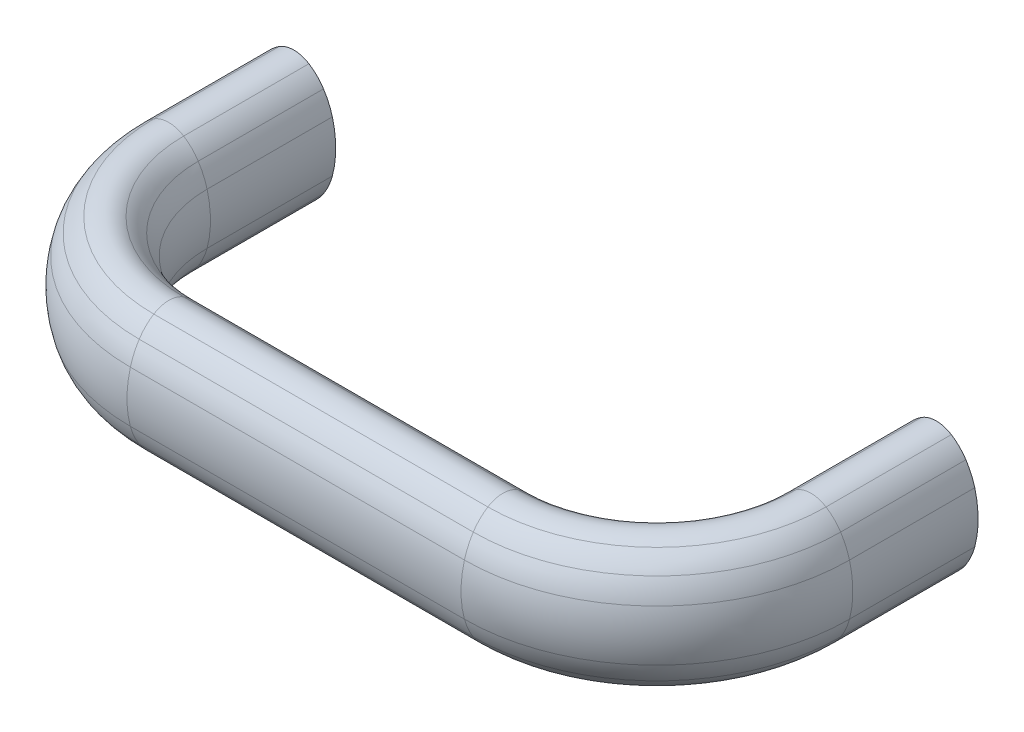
ISO-10303-21;
HEADER;
FILE_DESCRIPTION(('STEP AP214'),'2;1');
FILE_NAME('part.step','',(''),(''),'','','');
FILE_SCHEMA(('AUTOMOTIVE_DESIGN { 1 0 10303 214 1 1 1 1 }'));
ENDSEC;
DATA;
#1=APPLICATION_CONTEXT('core data for automotive mechanical design processes');
#2=APPLICATION_PROTOCOL_DEFINITION('international standard','automotive_design',2000,#1);
#3=PRODUCT_CONTEXT('',#1,'mechanical');
#4=PRODUCT('Part','Part','',(#3));
#5=PRODUCT_RELATED_PRODUCT_CATEGORY('part','',(#4));
#6=PRODUCT_DEFINITION_FORMATION('','',#4);
#7=PRODUCT_DEFINITION_CONTEXT('part definition',#1,'design');
#8=PRODUCT_DEFINITION('design','',#6,#7);
#9=PRODUCT_DEFINITION_SHAPE('','',#8);
#10=(LENGTH_UNIT() NAMED_UNIT(*) SI_UNIT(.MILLI.,.METRE.));
#11=(NAMED_UNIT(*) PLANE_ANGLE_UNIT() SI_UNIT($,.RADIAN.));
#12=(NAMED_UNIT(*) SI_UNIT($,.STERADIAN.) SOLID_ANGLE_UNIT());
#13=UNCERTAINTY_MEASURE_WITH_UNIT(LENGTH_MEASURE(1.E-05),#10,'distance_accuracy_value','');
#14=(GEOMETRIC_REPRESENTATION_CONTEXT(3) GLOBAL_UNCERTAINTY_ASSIGNED_CONTEXT((#13)) GLOBAL_UNIT_ASSIGNED_CONTEXT((#10,
#11,#12)) REPRESENTATION_CONTEXT('',''));
#15=CARTESIAN_POINT('',(0.,0.,0.));
#16=DIRECTION('',(0.,0.,1.));
#17=DIRECTION('',(1.,0.,0.));
#18=AXIS2_PLACEMENT_3D('',#15,#16,#17);
#19=CARTESIAN_POINT('',(98.2669801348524,2.95863916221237,19.4999999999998));
#20=DIRECTION('',(0.,0.,-1.));
#21=DIRECTION('',(0.,1.,0.));
#22=AXIS2_PLACEMENT_3D('',#19,#20,#21);
#23=CYLINDRICAL_SURFACE('',#22,7.54594714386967);
#24=CARTESIAN_POINT('',(98.2669801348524,2.95863916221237,19.4999999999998));
#25=DIRECTION('',(0.,0.,1.));
#26=DIRECTION('',(0.,1.,0.));
#27=AXIS2_PLACEMENT_3D('',#24,#25,#26);
#28=CIRCLE('',#27,7.54594714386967);
#29=CARTESIAN_POINT('',(104.593831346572,7.07109244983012,19.5));
#30=VERTEX_POINT('',#29);
#31=CARTESIAN_POINT('',(102.322235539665,9.32230335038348,19.5));
#32=VERTEX_POINT('',#31);
#33=EDGE_CURVE('E504',#30,#32,#28,.T.);
#34=ORIENTED_EDGE('',*,*,#33,.F.);
#35=DIRECTION('',(0.,0.,-1.));
#36=VECTOR('',#35,1.);
#37=CARTESIAN_POINT('',(104.593831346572,7.07109244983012,19.5));
#38=LINE('',#37,#36);
#39=CARTESIAN_POINT('',(104.593831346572,7.07109244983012,0.));
#40=VERTEX_POINT('',#39);
#41=EDGE_CURVE('E22',#30,#40,#38,.T.);
#42=ORIENTED_EDGE('',*,*,#41,.T.);
#43=CARTESIAN_POINT('',(98.2669801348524,2.95863916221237,-1.38777878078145E-13));
#44=DIRECTION('',(0.,0.,1.));
#45=DIRECTION('',(0.,1.,0.));
#46=AXIS2_PLACEMENT_3D('',#43,#44,#45);
#47=CIRCLE('',#46,7.54594714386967);
#48=CARTESIAN_POINT('',(102.322235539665,9.32230335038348,0.));
#49=VERTEX_POINT('',#48);
#50=EDGE_CURVE('E17',#40,#49,#47,.T.);
#51=ORIENTED_EDGE('',*,*,#50,.T.);
#52=DIRECTION('',(0.,0.,-1.));
#53=VECTOR('',#52,1.);
#54=CARTESIAN_POINT('',(102.322235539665,9.32230335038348,19.5));
#55=LINE('',#54,#53);
#56=EDGE_CURVE('E9',#32,#49,#55,.T.);
#57=ORIENTED_EDGE('',*,*,#56,.F.);
#58=EDGE_LOOP('',(#34,#42,#51,#57));
#59=FACE_BOUND('',#58,.T.);
#60=ADVANCED_FACE('F14',(#59),#23,.T.);
#61=CARTESIAN_POINT('',(95.5176677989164,1.17158614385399,19.5));
#62=DIRECTION('',(0.,0.,-1.));
#63=DIRECTION('',(0.,1.,0.));
#64=AXIS2_PLACEMENT_3D('',#61,#62,#63);
#65=CYLINDRICAL_SURFACE('',#64,10.8250135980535);
#66=CARTESIAN_POINT('',(95.5176677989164,1.17158614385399,19.5));
#67=DIRECTION('',(0.,0.,1.));
#68=DIRECTION('',(0.,1.,0.));
#69=AXIS2_PLACEMENT_3D('',#66,#67,#68);
#70=CIRCLE('',#69,10.8250135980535);
#71=CARTESIAN_POINT('',(105.97045040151,3.98588095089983,19.4999999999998));
#72=VERTEX_POINT('',#71);
#73=EDGE_CURVE('E564',#72,#30,#70,.T.);
#74=ORIENTED_EDGE('',*,*,#73,.F.);
#75=DIRECTION('',(0.,0.,-1.));
#76=VECTOR('',#75,1.);
#77=CARTESIAN_POINT('',(105.97045040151,3.98588095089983,19.4999999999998));
#78=LINE('',#77,#76);
#79=CARTESIAN_POINT('',(105.97045040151,3.98588095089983,-1.52655665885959E-13));
#80=VERTEX_POINT('',#79);
#81=EDGE_CURVE('E596',#72,#80,#78,.T.);
#82=ORIENTED_EDGE('',*,*,#81,.T.);
#83=CARTESIAN_POINT('',(95.5176677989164,1.17158614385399,0.));
#84=DIRECTION('',(0.,0.,1.));
#85=DIRECTION('',(0.,1.,0.));
#86=AXIS2_PLACEMENT_3D('',#83,#84,#85);
#87=CIRCLE('',#86,10.8250135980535);
#88=EDGE_CURVE('E38',#80,#40,#87,.T.);
#89=ORIENTED_EDGE('',*,*,#88,.T.);
#90=ORIENTED_EDGE('',*,*,#41,.F.);
#91=EDGE_LOOP('',(#74,#82,#89,#90));
#92=FACE_BOUND('',#91,.T.);
#93=ADVANCED_FACE('F685',(#92),#65,.T.);
#94=CARTESIAN_POINT('',(91.1662836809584,2.46379646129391E-05,19.5));
#95=DIRECTION('',(0.,0.,-1.));
#96=DIRECTION('',(0.,1.,0.));
#97=AXIS2_PLACEMENT_3D('',#94,#95,#96);
#98=CYLINDRICAL_SURFACE('',#97,15.331353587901);
#99=CARTESIAN_POINT('',(91.1662836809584,2.46379646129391E-05,19.5));
#100=DIRECTION('',(0.,0.,1.));
#101=DIRECTION('',(0.,1.,0.));
#102=AXIS2_PLACEMENT_3D('',#99,#100,#101);
#103=CIRCLE('',#102,15.331353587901);
#104=CARTESIAN_POINT('',(105.97045040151,-3.98583167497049,19.4999999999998));
#105=VERTEX_POINT('',#104);
#106=EDGE_CURVE('E562',#105,#72,#103,.T.);
#107=ORIENTED_EDGE('',*,*,#106,.F.);
#108=DIRECTION('',(0.,0.,-1.));
#109=VECTOR('',#108,1.);
#110=CARTESIAN_POINT('',(105.97045040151,-3.98583167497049,19.4999999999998));
#111=LINE('',#110,#109);
#112=CARTESIAN_POINT('',(105.97045040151,-3.98583167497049,-1.52655665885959E-13));
#113=VERTEX_POINT('',#112);
#114=EDGE_CURVE('E593',#105,#113,#111,.T.);
#115=ORIENTED_EDGE('',*,*,#114,.T.);
#116=CARTESIAN_POINT('',(91.1662836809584,2.46379646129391E-05,0.));
#117=DIRECTION('',(0.,0.,1.));
#118=DIRECTION('',(0.,1.,0.));
#119=AXIS2_PLACEMENT_3D('',#116,#117,#118);
#120=CIRCLE('',#119,15.331353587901);
#121=EDGE_CURVE('E622',#113,#80,#120,.T.);
#122=ORIENTED_EDGE('',*,*,#121,.T.);
#123=ORIENTED_EDGE('',*,*,#81,.F.);
#124=EDGE_LOOP('',(#107,#115,#122,#123));
#125=FACE_BOUND('',#124,.T.);
#126=ADVANCED_FACE('F690',(#125),#98,.T.);
#127=CARTESIAN_POINT('',(95.5176677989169,-1.1715368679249,19.5));
#128=DIRECTION('',(0.,0.,-1.));
#129=DIRECTION('',(0.,1.,0.));
#130=AXIS2_PLACEMENT_3D('',#127,#128,#129);
#131=CYLINDRICAL_SURFACE('',#130,10.8250135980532);
#132=CARTESIAN_POINT('',(95.5176677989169,-1.1715368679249,19.5));
#133=DIRECTION('',(0.,0.,1.));
#134=DIRECTION('',(0.,1.,0.));
#135=AXIS2_PLACEMENT_3D('',#132,#133,#134);
#136=CIRCLE('',#135,10.8250135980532);
#137=CARTESIAN_POINT('',(104.593831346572,-7.07104317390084,19.5));
#138=VERTEX_POINT('',#137);
#139=EDGE_CURVE('E559',#138,#105,#136,.T.);
#140=ORIENTED_EDGE('',*,*,#139,.F.);
#141=DIRECTION('',(0.,0.,-1.));
#142=VECTOR('',#141,1.);
#143=CARTESIAN_POINT('',(104.593831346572,-7.07104317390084,19.5));
#144=LINE('',#143,#142);
#145=CARTESIAN_POINT('',(104.593831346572,-7.07104317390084,0.));
#146=VERTEX_POINT('',#145);
#147=EDGE_CURVE('E590',#138,#146,#144,.T.);
#148=ORIENTED_EDGE('',*,*,#147,.T.);
#149=CARTESIAN_POINT('',(95.5176677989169,-1.1715368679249,0.));
#150=DIRECTION('',(0.,0.,1.));
#151=DIRECTION('',(0.,1.,0.));
#152=AXIS2_PLACEMENT_3D('',#149,#150,#151);
#153=CIRCLE('',#152,10.8250135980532);
#154=EDGE_CURVE('E620',#146,#113,#153,.T.);
#155=ORIENTED_EDGE('',*,*,#154,.T.);
#156=ORIENTED_EDGE('',*,*,#114,.F.);
#157=EDGE_LOOP('',(#140,#148,#155,#156));
#158=FACE_BOUND('',#157,.T.);
#159=ADVANCED_FACE('F695',(#158),#131,.T.);
#160=CARTESIAN_POINT('',(98.2669801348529,-2.95858988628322,19.4999999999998));
#161=DIRECTION('',(0.,0.,-1.));
#162=DIRECTION('',(0.,1.,0.));
#163=AXIS2_PLACEMENT_3D('',#160,#161,#162);
#164=CYLINDRICAL_SURFACE('',#163,7.54594714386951);
#165=CARTESIAN_POINT('',(98.2669801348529,-2.95858988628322,19.4999999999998));
#166=DIRECTION('',(0.,0.,1.));
#167=DIRECTION('',(0.,1.,0.));
#168=AXIS2_PLACEMENT_3D('',#165,#166,#167);
#169=CIRCLE('',#168,7.54594714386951);
#170=CARTESIAN_POINT('',(102.322235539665,-9.32225407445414,19.5));
#171=VERTEX_POINT('',#170);
#172=EDGE_CURVE('E556',#171,#138,#169,.T.);
#173=ORIENTED_EDGE('',*,*,#172,.F.);
#174=DIRECTION('',(0.,0.,-1.));
#175=VECTOR('',#174,1.);
#176=CARTESIAN_POINT('',(102.322235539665,-9.32225407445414,19.5));
#177=LINE('',#176,#175);
#178=CARTESIAN_POINT('',(102.322235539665,-9.32225407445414,0.));
#179=VERTEX_POINT('',#178);
#180=EDGE_CURVE('E587',#171,#179,#177,.T.);
#181=ORIENTED_EDGE('',*,*,#180,.T.);
#182=CARTESIAN_POINT('',(98.2669801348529,-2.95858988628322,-1.38777878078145E-13));
#183=DIRECTION('',(0.,0.,1.));
#184=DIRECTION('',(0.,1.,0.));
#185=AXIS2_PLACEMENT_3D('',#182,#183,#184);
#186=CIRCLE('',#185,7.54594714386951);
#187=EDGE_CURVE('E618',#179,#146,#186,.T.);
#188=ORIENTED_EDGE('',*,*,#187,.T.);
#189=ORIENTED_EDGE('',*,*,#147,.F.);
#190=EDGE_LOOP('',(#173,#181,#188,#189));
#191=FACE_BOUND('',#190,.T.);
#192=ADVANCED_FACE('F701',(#191),#164,.T.);
#193=CARTESIAN_POINT('',(99.9976372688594,-5.67440423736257,19.4999999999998));
#194=DIRECTION('',(0.,0.,-1.));
#195=DIRECTION('',(0.,1.,0.));
#196=AXIS2_PLACEMENT_3D('',#193,#194,#195);
#197=CYLINDRICAL_SURFACE('',#196,4.3255711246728);
#198=CARTESIAN_POINT('',(99.9976372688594,-5.67440423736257,19.4999999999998));
#199=DIRECTION('',(0.,0.,-1.));
#200=DIRECTION('',(0.,-1.,0.));
#201=AXIS2_PLACEMENT_3D('',#198,#199,#200);
#202=CIRCLE('',#201,4.3255711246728);
#203=CARTESIAN_POINT('',(97.6730389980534,-9.32225407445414,19.5));
#204=VERTEX_POINT('',#203);
#205=EDGE_CURVE('E553',#171,#204,#202,.T.);
#206=ORIENTED_EDGE('',*,*,#205,.T.);
#207=DIRECTION('',(0.,0.,-1.));
#208=VECTOR('',#207,1.);
#209=CARTESIAN_POINT('',(97.6730389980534,-9.32225407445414,19.5));
#210=LINE('',#209,#208);
#211=CARTESIAN_POINT('',(97.6730389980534,-9.32225407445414,0.));
#212=VERTEX_POINT('',#211);
#213=EDGE_CURVE('E584',#204,#212,#210,.T.);
#214=ORIENTED_EDGE('',*,*,#213,.T.);
#215=CARTESIAN_POINT('',(99.9976372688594,-5.67440423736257,-1.52655665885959E-13));
#216=DIRECTION('',(0.,0.,-1.));
#217=DIRECTION('',(0.,-1.,0.));
#218=AXIS2_PLACEMENT_3D('',#215,#216,#217);
#219=CIRCLE('',#218,4.3255711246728);
#220=EDGE_CURVE('E615',#179,#212,#219,.T.);
#221=ORIENTED_EDGE('',*,*,#220,.F.);
#222=ORIENTED_EDGE('',*,*,#180,.F.);
#223=EDGE_LOOP('',(#206,#214,#221,#222));
#224=FACE_BOUND('',#223,.T.);
#225=ADVANCED_FACE('F705',(#224),#197,.T.);
#226=CARTESIAN_POINT('',(101.728294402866,-2.95858988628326,19.5));
#227=DIRECTION('',(0.,0.,-1.));
#228=DIRECTION('',(0.,1.,0.));
#229=AXIS2_PLACEMENT_3D('',#226,#227,#228);
#230=CYLINDRICAL_SURFACE('',#229,7.54594714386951);
#231=CARTESIAN_POINT('',(101.728294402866,-2.95858988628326,19.5));
#232=DIRECTION('',(0.,0.,-1.));
#233=DIRECTION('',(0.,-1.,0.));
#234=AXIS2_PLACEMENT_3D('',#231,#232,#233);
#235=CIRCLE('',#234,7.54594714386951);
#236=CARTESIAN_POINT('',(95.4014431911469,-7.07104317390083,19.5));
#237=VERTEX_POINT('',#236);
#238=EDGE_CURVE('E550',#204,#237,#235,.T.);
#239=ORIENTED_EDGE('',*,*,#238,.T.);
#240=DIRECTION('',(0.,0.,-1.));
#241=VECTOR('',#240,1.);
#242=CARTESIAN_POINT('',(95.4014431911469,-7.07104317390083,19.5));
#243=LINE('',#242,#241);
#244=CARTESIAN_POINT('',(95.4014431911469,-7.07104317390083,0.));
#245=VERTEX_POINT('',#244);
#246=EDGE_CURVE('E581',#237,#245,#243,.T.);
#247=ORIENTED_EDGE('',*,*,#246,.T.);
#248=CARTESIAN_POINT('',(101.728294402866,-2.95858988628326,0.));
#249=DIRECTION('',(0.,0.,-1.));
#250=DIRECTION('',(0.,-1.,0.));
#251=AXIS2_PLACEMENT_3D('',#248,#249,#250);
#252=CIRCLE('',#251,7.54594714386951);
#253=EDGE_CURVE('E612',#212,#245,#252,.T.);
#254=ORIENTED_EDGE('',*,*,#253,.F.);
#255=ORIENTED_EDGE('',*,*,#213,.F.);
#256=EDGE_LOOP('',(#239,#247,#254,#255));
#257=FACE_BOUND('',#256,.T.);
#258=ADVANCED_FACE('F709',(#257),#230,.T.);
#259=CARTESIAN_POINT('',(104.477606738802,-1.17153686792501,19.5));
#260=DIRECTION('',(0.,0.,-1.));
#261=DIRECTION('',(0.,1.,0.));
#262=AXIS2_PLACEMENT_3D('',#259,#260,#261);
#263=CYLINDRICAL_SURFACE('',#262,10.8250135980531);
#264=CARTESIAN_POINT('',(104.477606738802,-1.17153686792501,19.5));
#265=DIRECTION('',(0.,0.,-1.));
#266=DIRECTION('',(0.,-1.,0.));
#267=AXIS2_PLACEMENT_3D('',#264,#265,#266);
#268=CIRCLE('',#267,10.8250135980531);
#269=CARTESIAN_POINT('',(94.0248241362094,-3.98583167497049,19.5));
#270=VERTEX_POINT('',#269);
#271=EDGE_CURVE('E547',#237,#270,#268,.T.);
#272=ORIENTED_EDGE('',*,*,#271,.T.);
#273=DIRECTION('',(0.,0.,-1.));
#274=VECTOR('',#273,1.);
#275=CARTESIAN_POINT('',(94.0248241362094,-3.98583167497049,19.5));
#276=LINE('',#275,#274);
#277=CARTESIAN_POINT('',(94.0248241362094,-3.98583167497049,0.));
#278=VERTEX_POINT('',#277);
#279=EDGE_CURVE('E578',#270,#278,#276,.T.);
#280=ORIENTED_EDGE('',*,*,#279,.T.);
#281=CARTESIAN_POINT('',(104.477606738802,-1.17153686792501,0.));
#282=DIRECTION('',(0.,0.,-1.));
#283=DIRECTION('',(0.,-1.,0.));
#284=AXIS2_PLACEMENT_3D('',#281,#282,#283);
#285=CIRCLE('',#284,10.8250135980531);
#286=EDGE_CURVE('E609',#245,#278,#285,.T.);
#287=ORIENTED_EDGE('',*,*,#286,.F.);
#288=ORIENTED_EDGE('',*,*,#246,.F.);
#289=EDGE_LOOP('',(#272,#280,#287,#288));
#290=FACE_BOUND('',#289,.T.);
#291=ADVANCED_FACE('F713',(#290),#263,.T.);
#292=CARTESIAN_POINT('',(108.82899085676,2.46379646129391E-05,19.4999999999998));
#293=DIRECTION('',(0.,0.,-1.));
#294=DIRECTION('',(0.,1.,0.));
#295=AXIS2_PLACEMENT_3D('',#292,#293,#294);
#296=CYLINDRICAL_SURFACE('',#295,15.331353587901);
#297=CARTESIAN_POINT('',(108.82899085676,2.46379646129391E-05,19.4999999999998));
#298=DIRECTION('',(0.,0.,-1.));
#299=DIRECTION('',(0.,-1.,0.));
#300=AXIS2_PLACEMENT_3D('',#297,#298,#299);
#301=CIRCLE('',#300,15.331353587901);
#302=CARTESIAN_POINT('',(94.0248241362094,3.98588095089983,19.5));
#303=VERTEX_POINT('',#302);
#304=EDGE_CURVE('E544',#270,#303,#301,.T.);
#305=ORIENTED_EDGE('',*,*,#304,.T.);
#306=DIRECTION('',(0.,0.,-1.));
#307=VECTOR('',#306,1.);
#308=CARTESIAN_POINT('',(94.0248241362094,3.98588095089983,19.5));
#309=LINE('',#308,#307);
#310=CARTESIAN_POINT('',(94.0248241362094,3.98588095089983,0.));
#311=VERTEX_POINT('',#310);
#312=EDGE_CURVE('E575',#303,#311,#309,.T.);
#313=ORIENTED_EDGE('',*,*,#312,.T.);
#314=CARTESIAN_POINT('',(108.82899085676,2.46379646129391E-05,-1.52655665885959E-13));
#315=DIRECTION('',(0.,0.,-1.));
#316=DIRECTION('',(0.,-1.,0.));
#317=AXIS2_PLACEMENT_3D('',#314,#315,#316);
#318=CIRCLE('',#317,15.331353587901);
#319=EDGE_CURVE('E606',#278,#311,#318,.T.);
#320=ORIENTED_EDGE('',*,*,#319,.F.);
#321=ORIENTED_EDGE('',*,*,#279,.F.);
#322=EDGE_LOOP('',(#305,#313,#320,#321));
#323=FACE_BOUND('',#322,.T.);
#324=ADVANCED_FACE('F717',(#323),#296,.T.);
#325=CARTESIAN_POINT('',(104.477606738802,1.1715861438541,19.5));
#326=DIRECTION('',(0.,0.,-1.));
#327=DIRECTION('',(0.,1.,0.));
#328=AXIS2_PLACEMENT_3D('',#325,#326,#327);
#329=CYLINDRICAL_SURFACE('',#328,10.8250135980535);
#330=CARTESIAN_POINT('',(104.477606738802,1.1715861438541,19.5));
#331=DIRECTION('',(0.,0.,-1.));
#332=DIRECTION('',(0.,-1.,0.));
#333=AXIS2_PLACEMENT_3D('',#330,#331,#332);
#334=CIRCLE('',#333,10.8250135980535);
#335=CARTESIAN_POINT('',(95.4014431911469,7.07109244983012,19.5));
#336=VERTEX_POINT('',#335);
#337=EDGE_CURVE('E541',#303,#336,#334,.T.);
#338=ORIENTED_EDGE('',*,*,#337,.T.);
#339=DIRECTION('',(0.,0.,-1.));
#340=VECTOR('',#339,1.);
#341=CARTESIAN_POINT('',(95.4014431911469,7.07109244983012,19.5));
#342=LINE('',#341,#340);
#343=CARTESIAN_POINT('',(95.4014431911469,7.07109244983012,0.));
#344=VERTEX_POINT('',#343);
#345=EDGE_CURVE('E572',#336,#344,#342,.T.);
#346=ORIENTED_EDGE('',*,*,#345,.T.);
#347=CARTESIAN_POINT('',(104.477606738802,1.1715861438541,0.));
#348=DIRECTION('',(0.,0.,-1.));
#349=DIRECTION('',(0.,-1.,0.));
#350=AXIS2_PLACEMENT_3D('',#347,#348,#349);
#351=CIRCLE('',#350,10.8250135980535);
#352=EDGE_CURVE('E603',#311,#344,#351,.T.);
#353=ORIENTED_EDGE('',*,*,#352,.F.);
#354=ORIENTED_EDGE('',*,*,#312,.F.);
#355=EDGE_LOOP('',(#338,#346,#353,#354));
#356=FACE_BOUND('',#355,.T.);
#357=ADVANCED_FACE('F721',(#356),#329,.T.);
#358=CARTESIAN_POINT('',(101.728294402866,2.95863916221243,19.5));
#359=DIRECTION('',(0.,0.,-1.));
#360=DIRECTION('',(0.,1.,0.));
#361=AXIS2_PLACEMENT_3D('',#358,#359,#360);
#362=CYLINDRICAL_SURFACE('',#361,7.54594714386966);
#363=CARTESIAN_POINT('',(101.728294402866,2.95863916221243,19.5));
#364=DIRECTION('',(0.,0.,-1.));
#365=DIRECTION('',(0.,-1.,0.));
#366=AXIS2_PLACEMENT_3D('',#363,#364,#365);
#367=CIRCLE('',#366,7.54594714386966);
#368=CARTESIAN_POINT('',(97.6730389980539,9.32230335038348,19.5));
#369=VERTEX_POINT('',#368);
#370=EDGE_CURVE('E538',#336,#369,#367,.T.);
#371=ORIENTED_EDGE('',*,*,#370,.T.);
#372=DIRECTION('',(0.,0.,-1.));
#373=VECTOR('',#372,1.);
#374=CARTESIAN_POINT('',(97.6730389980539,9.32230335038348,19.5));
#375=LINE('',#374,#373);
#376=CARTESIAN_POINT('',(97.6730389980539,9.32230335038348,0.));
#377=VERTEX_POINT('',#376);
#378=EDGE_CURVE('E569',#369,#377,#375,.T.);
#379=ORIENTED_EDGE('',*,*,#378,.T.);
#380=CARTESIAN_POINT('',(101.728294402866,2.95863916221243,0.));
#381=DIRECTION('',(0.,0.,-1.));
#382=DIRECTION('',(0.,-1.,0.));
#383=AXIS2_PLACEMENT_3D('',#380,#381,#382);
#384=CIRCLE('',#383,7.54594714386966);
#385=EDGE_CURVE('E601',#344,#377,#384,.T.);
#386=ORIENTED_EDGE('',*,*,#385,.F.);
#387=ORIENTED_EDGE('',*,*,#345,.F.);
#388=EDGE_LOOP('',(#371,#379,#386,#387));
#389=FACE_BOUND('',#388,.T.);
#390=ADVANCED_FACE('F682',(#389),#362,.T.);
#391=CARTESIAN_POINT('',(99.9976372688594,5.67445351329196,19.4999999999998));
#392=DIRECTION('',(0.,0.,-1.));
#393=DIRECTION('',(0.,1.,0.));
#394=AXIS2_PLACEMENT_3D('',#391,#392,#393);
#395=CYLINDRICAL_SURFACE('',#394,4.32557112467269);
#396=CARTESIAN_POINT('',(99.9976372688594,5.67445351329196,19.4999999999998));
#397=DIRECTION('',(0.,0.,-1.));
#398=DIRECTION('',(0.,-1.,0.));
#399=AXIS2_PLACEMENT_3D('',#396,#397,#398);
#400=CIRCLE('',#399,4.32557112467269);
#401=EDGE_CURVE('E467',#369,#32,#400,.T.);
#402=ORIENTED_EDGE('',*,*,#401,.T.);
#403=ORIENTED_EDGE('',*,*,#56,.T.);
#404=CARTESIAN_POINT('',(99.9976372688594,5.67445351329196,-1.52655665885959E-13));
#405=DIRECTION('',(0.,0.,-1.));
#406=DIRECTION('',(0.,-1.,0.));
#407=AXIS2_PLACEMENT_3D('',#404,#405,#406);
#408=CIRCLE('',#407,4.32557112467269);
#409=EDGE_CURVE('E30',#377,#49,#408,.T.);
#410=ORIENTED_EDGE('',*,*,#409,.F.);
#411=ORIENTED_EDGE('',*,*,#378,.F.);
#412=EDGE_LOOP('',(#402,#403,#410,#411));
#413=FACE_BOUND('',#412,.T.);
#414=ADVANCED_FACE('F627',(#413),#395,.T.);
#415=CARTESIAN_POINT('',(76.,2.95863916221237,19.5));
#416=DIRECTION('',(0.,1.,0.));
#417=DIRECTION('',(-1.,0.,0.));
#418=AXIS2_PLACEMENT_3D('',#415,#416,#417);
#419=TOROIDAL_SURFACE('',#418,22.2669801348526,7.54594714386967);
#420=CARTESIAN_POINT('',(76.,2.95863916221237,41.7669801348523));
#421=DIRECTION('',(-1.,0.,0.));
#422=DIRECTION('',(0.,1.,0.));
#423=AXIS2_PLACEMENT_3D('',#420,#421,#422);
#424=CIRCLE('',#423,7.54594714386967);
#425=CARTESIAN_POINT('',(76.,7.07109244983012,48.093831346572));
#426=VERTEX_POINT('',#425);
#427=CARTESIAN_POINT('',(76.,9.32230335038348,45.8222355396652));
#428=VERTEX_POINT('',#427);
#429=EDGE_CURVE('E434',#426,#428,#424,.T.);
#430=ORIENTED_EDGE('',*,*,#429,.F.);
#431=CARTESIAN_POINT('',(76.,7.07109244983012,19.5));
#432=DIRECTION('',(0.,1.,0.));
#433=DIRECTION('',(-1.,0.,0.));
#434=AXIS2_PLACEMENT_3D('',#431,#432,#433);
#435=CIRCLE('',#434,28.5938313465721);
#436=EDGE_CURVE('E531',#426,#30,#435,.T.);
#437=ORIENTED_EDGE('',*,*,#436,.T.);
#438=ORIENTED_EDGE('',*,*,#33,.T.);
#439=CARTESIAN_POINT('',(76.,9.32230335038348,19.5));
#440=DIRECTION('',(0.,1.,0.));
#441=DIRECTION('',(-1.,0.,0.));
#442=AXIS2_PLACEMENT_3D('',#439,#440,#441);
#443=CIRCLE('',#442,26.3222355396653);
#444=EDGE_CURVE('E534',#428,#32,#443,.T.);
#445=ORIENTED_EDGE('',*,*,#444,.F.);
#446=EDGE_LOOP('',(#430,#437,#438,#445));
#447=FACE_BOUND('',#446,.T.);
#448=ADVANCED_FACE('F671',(#447),#419,.T.);
#449=CARTESIAN_POINT('',(76.,1.17158614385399,19.5));
#450=DIRECTION('',(0.,1.,0.));
#451=DIRECTION('',(-1.,0.,0.));
#452=AXIS2_PLACEMENT_3D('',#449,#450,#451);
#453=TOROIDAL_SURFACE('',#452,19.5176677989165,10.8250135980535);
#454=CARTESIAN_POINT('',(76.,1.17158614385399,39.0176677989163));
#455=DIRECTION('',(-1.,0.,0.));
#456=DIRECTION('',(0.,1.,0.));
#457=AXIS2_PLACEMENT_3D('',#454,#455,#456);
#458=CIRCLE('',#457,10.8250135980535);
#459=CARTESIAN_POINT('',(76.,3.98588095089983,49.4704504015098));
#460=VERTEX_POINT('',#459);
#461=EDGE_CURVE('E495',#460,#426,#458,.T.);
#462=ORIENTED_EDGE('',*,*,#461,.F.);
#463=CARTESIAN_POINT('',(76.,3.98588095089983,19.5));
#464=DIRECTION('',(0.,1.,0.));
#465=DIRECTION('',(-1.,0.,0.));
#466=AXIS2_PLACEMENT_3D('',#463,#464,#465);
#467=CIRCLE('',#466,29.9704504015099);
#468=EDGE_CURVE('E528',#460,#72,#467,.T.);
#469=ORIENTED_EDGE('',*,*,#468,.T.);
#470=ORIENTED_EDGE('',*,*,#73,.T.);
#471=ORIENTED_EDGE('',*,*,#436,.F.);
#472=EDGE_LOOP('',(#462,#469,#470,#471));
#473=FACE_BOUND('',#472,.T.);
#474=ADVANCED_FACE('F666',(#473),#453,.T.);
#475=CARTESIAN_POINT('',(76.,2.46379646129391E-05,19.5));
#476=DIRECTION('',(0.,1.,0.));
#477=DIRECTION('',(-1.,0.,0.));
#478=AXIS2_PLACEMENT_3D('',#475,#476,#477);
#479=DEGENERATE_TOROIDAL_SURFACE('',#478,15.1662836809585,15.331353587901,.T.);
#480=CARTESIAN_POINT('',(76.,2.46379646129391E-05,34.6662836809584));
#481=DIRECTION('',(-1.,0.,0.));
#482=DIRECTION('',(0.,1.,0.));
#483=AXIS2_PLACEMENT_3D('',#480,#481,#482);
#484=CIRCLE('',#483,15.331353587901);
#485=CARTESIAN_POINT('',(76.,-3.98583167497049,49.4704504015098));
#486=VERTEX_POINT('',#485);
#487=EDGE_CURVE('E493',#486,#460,#484,.T.);
#488=ORIENTED_EDGE('',*,*,#487,.F.);
#489=CARTESIAN_POINT('',(76.,-3.98583167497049,19.5));
#490=DIRECTION('',(0.,1.,0.));
#491=DIRECTION('',(-1.,0.,0.));
#492=AXIS2_PLACEMENT_3D('',#489,#490,#491);
#493=CIRCLE('',#492,29.9704504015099);
#494=EDGE_CURVE('E525',#486,#105,#493,.T.);
#495=ORIENTED_EDGE('',*,*,#494,.T.);
#496=ORIENTED_EDGE('',*,*,#106,.T.);
#497=ORIENTED_EDGE('',*,*,#468,.F.);
#498=EDGE_LOOP('',(#488,#495,#496,#497));
#499=FACE_BOUND('',#498,.T.);
#500=ADVANCED_FACE('F680',(#499),#479,.T.);
#501=CARTESIAN_POINT('',(76.,-1.1715368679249,19.5));
#502=DIRECTION('',(0.,1.,0.));
#503=DIRECTION('',(-1.,0.,0.));
#504=AXIS2_PLACEMENT_3D('',#501,#502,#503);
#505=TOROIDAL_SURFACE('',#504,19.5176677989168,10.8250135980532);
#506=CARTESIAN_POINT('',(76.,-1.1715368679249,39.0176677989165));
#507=DIRECTION('',(-1.,0.,0.));
#508=DIRECTION('',(0.,1.,0.));
#509=AXIS2_PLACEMENT_3D('',#506,#507,#508);
#510=CIRCLE('',#509,10.8250135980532);
#511=CARTESIAN_POINT('',(76.,-7.07104317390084,48.093831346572));
#512=VERTEX_POINT('',#511);
#513=EDGE_CURVE('E490',#512,#486,#510,.T.);
#514=ORIENTED_EDGE('',*,*,#513,.F.);
#515=CARTESIAN_POINT('',(76.,-7.07104317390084,19.5));
#516=DIRECTION('',(0.,1.,0.));
#517=DIRECTION('',(-1.,0.,0.));
#518=AXIS2_PLACEMENT_3D('',#515,#516,#517);
#519=CIRCLE('',#518,28.5938313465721);
#520=EDGE_CURVE('E522',#512,#138,#519,.T.);
#521=ORIENTED_EDGE('',*,*,#520,.T.);
#522=ORIENTED_EDGE('',*,*,#139,.T.);
#523=ORIENTED_EDGE('',*,*,#494,.F.);
#524=EDGE_LOOP('',(#514,#521,#522,#523));
#525=FACE_BOUND('',#524,.T.);
#526=ADVANCED_FACE('F898',(#525),#505,.T.);
#527=CARTESIAN_POINT('',(76.,-2.95858988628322,19.5));
#528=DIRECTION('',(0.,1.,0.));
#529=DIRECTION('',(-1.,0.,0.));
#530=AXIS2_PLACEMENT_3D('',#527,#528,#529);
#531=TOROIDAL_SURFACE('',#530,22.2669801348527,7.54594714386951);
#532=CARTESIAN_POINT('',(76.,-2.95858988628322,41.7669801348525));
#533=DIRECTION('',(-1.,0.,0.));
#534=DIRECTION('',(0.,1.,0.));
#535=AXIS2_PLACEMENT_3D('',#532,#533,#534);
#536=CIRCLE('',#535,7.54594714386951);
#537=CARTESIAN_POINT('',(76.,-9.32225407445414,45.8222355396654));
#538=VERTEX_POINT('',#537);
#539=EDGE_CURVE('E487',#538,#512,#536,.T.);
#540=ORIENTED_EDGE('',*,*,#539,.F.);
#541=CARTESIAN_POINT('',(76.,-9.32225407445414,19.5));
#542=DIRECTION('',(0.,1.,0.));
#543=DIRECTION('',(-1.,0.,0.));
#544=AXIS2_PLACEMENT_3D('',#541,#542,#543);
#545=CIRCLE('',#544,26.3222355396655);
#546=EDGE_CURVE('E519',#538,#171,#545,.T.);
#547=ORIENTED_EDGE('',*,*,#546,.T.);
#548=ORIENTED_EDGE('',*,*,#172,.T.);
#549=ORIENTED_EDGE('',*,*,#520,.F.);
#550=EDGE_LOOP('',(#540,#547,#548,#549));
#551=FACE_BOUND('',#550,.T.);
#552=ADVANCED_FACE('F894',(#551),#531,.T.);
#553=CARTESIAN_POINT('',(76.,-5.67440423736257,19.5));
#554=DIRECTION('',(0.,1.,0.));
#555=DIRECTION('',(-1.,0.,0.));
#556=AXIS2_PLACEMENT_3D('',#553,#554,#555);
#557=TOROIDAL_SURFACE('',#556,23.9976372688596,4.3255711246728);
#558=CARTESIAN_POINT('',(76.,-5.67440423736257,43.4976372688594));
#559=DIRECTION('',(1.,0.,0.));
#560=DIRECTION('',(0.,-1.,0.));
#561=AXIS2_PLACEMENT_3D('',#558,#559,#560);
#562=CIRCLE('',#561,4.3255711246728);
#563=CARTESIAN_POINT('',(76.,-9.32225407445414,41.1730389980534));
#564=VERTEX_POINT('',#563);
#565=EDGE_CURVE('E484',#538,#564,#562,.T.);
#566=ORIENTED_EDGE('',*,*,#565,.T.);
#567=CARTESIAN_POINT('',(76.,-9.32225407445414,19.5));
#568=DIRECTION('',(0.,1.,0.));
#569=DIRECTION('',(-1.,0.,0.));
#570=AXIS2_PLACEMENT_3D('',#567,#568,#569);
#571=CIRCLE('',#570,21.6730389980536);
#572=EDGE_CURVE('E516',#564,#204,#571,.T.);
#573=ORIENTED_EDGE('',*,*,#572,.T.);
#574=ORIENTED_EDGE('',*,*,#205,.F.);
#575=ORIENTED_EDGE('',*,*,#546,.F.);
#576=EDGE_LOOP('',(#566,#573,#574,#575));
#577=FACE_BOUND('',#576,.T.);
#578=ADVANCED_FACE('F890',(#577),#557,.T.);
#579=CARTESIAN_POINT('',(76.,-2.95858988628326,19.5));
#580=DIRECTION('',(0.,1.,0.));
#581=DIRECTION('',(-1.,0.,0.));
#582=AXIS2_PLACEMENT_3D('',#579,#580,#581);
#583=TOROIDAL_SURFACE('',#582,25.7282944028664,7.54594714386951);
#584=CARTESIAN_POINT('',(76.,-2.95858988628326,45.2282944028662));
#585=DIRECTION('',(1.,0.,0.));
#586=DIRECTION('',(0.,-1.,0.));
#587=AXIS2_PLACEMENT_3D('',#584,#585,#586);
#588=CIRCLE('',#587,7.54594714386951);
#589=CARTESIAN_POINT('',(76.,-7.07104317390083,38.9014431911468));
#590=VERTEX_POINT('',#589);
#591=EDGE_CURVE('E481',#564,#590,#588,.T.);
#592=ORIENTED_EDGE('',*,*,#591,.T.);
#593=CARTESIAN_POINT('',(76.,-7.07104317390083,19.5));
#594=DIRECTION('',(0.,1.,0.));
#595=DIRECTION('',(-1.,0.,0.));
#596=AXIS2_PLACEMENT_3D('',#593,#594,#595);
#597=CIRCLE('',#596,19.401443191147);
#598=EDGE_CURVE('E513',#590,#237,#597,.T.);
#599=ORIENTED_EDGE('',*,*,#598,.T.);
#600=ORIENTED_EDGE('',*,*,#238,.F.);
#601=ORIENTED_EDGE('',*,*,#572,.F.);
#602=EDGE_LOOP('',(#592,#599,#600,#601));
#603=FACE_BOUND('',#602,.T.);
#604=ADVANCED_FACE('F886',(#603),#583,.T.);
#605=CARTESIAN_POINT('',(76.,-1.17153686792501,19.5));
#606=DIRECTION('',(0.,1.,0.));
#607=DIRECTION('',(-1.,0.,0.));
#608=AXIS2_PLACEMENT_3D('',#605,#606,#607);
#609=TOROIDAL_SURFACE('',#608,28.4776067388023,10.8250135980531);
#610=CARTESIAN_POINT('',(76.,-1.17153686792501,47.9776067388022));
#611=DIRECTION('',(1.,0.,0.));
#612=DIRECTION('',(0.,-1.,0.));
#613=AXIS2_PLACEMENT_3D('',#610,#611,#612);
#614=CIRCLE('',#613,10.8250135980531);
#615=CARTESIAN_POINT('',(76.,-3.98583167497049,37.5248241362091));
#616=VERTEX_POINT('',#615);
#617=EDGE_CURVE('E478',#590,#616,#614,.T.);
#618=ORIENTED_EDGE('',*,*,#617,.T.);
#619=CARTESIAN_POINT('',(76.,-3.98583167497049,19.5));
#620=DIRECTION('',(0.,1.,0.));
#621=DIRECTION('',(-1.,0.,0.));
#622=AXIS2_PLACEMENT_3D('',#619,#620,#621);
#623=CIRCLE('',#622,18.0248241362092);
#624=EDGE_CURVE('E510',#616,#270,#623,.T.);
#625=ORIENTED_EDGE('',*,*,#624,.T.);
#626=ORIENTED_EDGE('',*,*,#271,.F.);
#627=ORIENTED_EDGE('',*,*,#598,.F.);
#628=EDGE_LOOP('',(#618,#625,#626,#627));
#629=FACE_BOUND('',#628,.T.);
#630=ADVANCED_FACE('F883',(#629),#609,.T.);
#631=CARTESIAN_POINT('',(76.,2.46379646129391E-05,19.5));
#632=DIRECTION('',(0.,1.,0.));
#633=DIRECTION('',(-1.,0.,0.));
#634=AXIS2_PLACEMENT_3D('',#631,#632,#633);
#635=TOROIDAL_SURFACE('',#634,32.8289908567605,15.331353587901);
#636=CARTESIAN_POINT('',(76.,2.46379646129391E-05,52.3289908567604));
#637=DIRECTION('',(1.,0.,0.));
#638=DIRECTION('',(0.,-1.,0.));
#639=AXIS2_PLACEMENT_3D('',#636,#637,#638);
#640=CIRCLE('',#639,15.331353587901);
#641=CARTESIAN_POINT('',(76.,3.98588095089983,37.5248241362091));
#642=VERTEX_POINT('',#641);
#643=EDGE_CURVE('E475',#616,#642,#640,.T.);
#644=ORIENTED_EDGE('',*,*,#643,.T.);
#645=CARTESIAN_POINT('',(76.,3.98588095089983,19.5));
#646=DIRECTION('',(0.,1.,0.));
#647=DIRECTION('',(-1.,0.,0.));
#648=AXIS2_PLACEMENT_3D('',#645,#646,#647);
#649=CIRCLE('',#648,18.0248241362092);
#650=EDGE_CURVE('E507',#642,#303,#649,.T.);
#651=ORIENTED_EDGE('',*,*,#650,.T.);
#652=ORIENTED_EDGE('',*,*,#304,.F.);
#653=ORIENTED_EDGE('',*,*,#624,.F.);
#654=EDGE_LOOP('',(#644,#651,#652,#653));
#655=FACE_BOUND('',#654,.T.);
#656=ADVANCED_FACE('F735',(#655),#635,.T.);
#657=CARTESIAN_POINT('',(76.,1.1715861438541,19.5));
#658=DIRECTION('',(0.,1.,0.));
#659=DIRECTION('',(-1.,0.,0.));
#660=AXIS2_PLACEMENT_3D('',#657,#658,#659);
#661=TOROIDAL_SURFACE('',#660,28.4776067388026,10.8250135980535);
#662=CARTESIAN_POINT('',(76.,1.1715861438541,47.9776067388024));
#663=DIRECTION('',(1.,0.,0.));
#664=DIRECTION('',(0.,-1.,0.));
#665=AXIS2_PLACEMENT_3D('',#662,#663,#664);
#666=CIRCLE('',#665,10.8250135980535);
#667=CARTESIAN_POINT('',(76.,7.07109244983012,38.9014431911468));
#668=VERTEX_POINT('',#667);
#669=EDGE_CURVE('E472',#642,#668,#666,.T.);
#670=ORIENTED_EDGE('',*,*,#669,.T.);
#671=CARTESIAN_POINT('',(76.,7.07109244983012,19.5));
#672=DIRECTION('',(0.,1.,0.));
#673=DIRECTION('',(-1.,0.,0.));
#674=AXIS2_PLACEMENT_3D('',#671,#672,#673);
#675=CIRCLE('',#674,19.401443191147);
#676=EDGE_CURVE('E503',#668,#336,#675,.T.);
#677=ORIENTED_EDGE('',*,*,#676,.T.);
#678=ORIENTED_EDGE('',*,*,#337,.F.);
#679=ORIENTED_EDGE('',*,*,#650,.F.);
#680=EDGE_LOOP('',(#670,#677,#678,#679));
#681=FACE_BOUND('',#680,.T.);
#682=ADVANCED_FACE('F733',(#681),#661,.T.);
#683=CARTESIAN_POINT('',(76.,2.95863916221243,19.5));
#684=DIRECTION('',(0.,1.,0.));
#685=DIRECTION('',(-1.,0.,0.));
#686=AXIS2_PLACEMENT_3D('',#683,#684,#685);
#687=TOROIDAL_SURFACE('',#686,25.7282944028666,7.54594714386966);
#688=CARTESIAN_POINT('',(76.,2.95863916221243,45.2282944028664));
#689=DIRECTION('',(1.,0.,0.));
#690=DIRECTION('',(0.,-1.,0.));
#691=AXIS2_PLACEMENT_3D('',#688,#689,#690);
#692=CIRCLE('',#691,7.54594714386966);
#693=CARTESIAN_POINT('',(76.,9.32230335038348,41.1730389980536));
#694=VERTEX_POINT('',#693);
#695=EDGE_CURVE('E469',#668,#694,#692,.T.);
#696=ORIENTED_EDGE('',*,*,#695,.T.);
#697=CARTESIAN_POINT('',(76.,9.32230335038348,19.5));
#698=DIRECTION('',(0.,1.,0.));
#699=DIRECTION('',(-1.,0.,0.));
#700=AXIS2_PLACEMENT_3D('',#697,#698,#699);
#701=CIRCLE('',#700,21.6730389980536);
#702=EDGE_CURVE('E500',#694,#369,#701,.T.);
#703=ORIENTED_EDGE('',*,*,#702,.T.);
#704=ORIENTED_EDGE('',*,*,#370,.F.);
#705=ORIENTED_EDGE('',*,*,#676,.F.);
#706=EDGE_LOOP('',(#696,#703,#704,#705));
#707=FACE_BOUND('',#706,.T.);
#708=ADVANCED_FACE('F634',(#707),#687,.T.);
#709=CARTESIAN_POINT('',(76.,5.67445351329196,19.5));
#710=DIRECTION('',(0.,1.,0.));
#711=DIRECTION('',(-1.,0.,0.));
#712=AXIS2_PLACEMENT_3D('',#709,#710,#711);
#713=TOROIDAL_SURFACE('',#712,23.9976372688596,4.32557112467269);
#714=CARTESIAN_POINT('',(76.,5.67445351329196,43.4976372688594));
#715=DIRECTION('',(1.,0.,0.));
#716=DIRECTION('',(0.,-1.,0.));
#717=AXIS2_PLACEMENT_3D('',#714,#715,#716);
#718=CIRCLE('',#717,4.32557112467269);
#719=EDGE_CURVE('E397',#694,#428,#718,.T.);
#720=ORIENTED_EDGE('',*,*,#719,.T.);
#721=ORIENTED_EDGE('',*,*,#444,.T.);
#722=ORIENTED_EDGE('',*,*,#401,.F.);
#723=ORIENTED_EDGE('',*,*,#702,.F.);
#724=EDGE_LOOP('',(#720,#721,#722,#723));
#725=FACE_BOUND('',#724,.T.);
#726=ADVANCED_FACE('F630',(#725),#713,.T.);
#727=CARTESIAN_POINT('',(24.,2.95863916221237,41.7669801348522));
#728=DIRECTION('',(1.,0.,0.));
#729=DIRECTION('',(0.,0.,1.));
#730=AXIS2_PLACEMENT_3D('',#727,#728,#729);
#731=CYLINDRICAL_SURFACE('',#730,7.54594714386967);
#732=CARTESIAN_POINT('',(24.,2.95863916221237,41.7669801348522));
#733=DIRECTION('',(-1.,0.,0.));
#734=DIRECTION('',(0.,1.,0.));
#735=AXIS2_PLACEMENT_3D('',#732,#733,#734);
#736=CIRCLE('',#735,7.54594714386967);
#737=CARTESIAN_POINT('',(24.,7.07109244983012,48.0938313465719));
#738=VERTEX_POINT('',#737);
#739=CARTESIAN_POINT('',(24.,9.32230335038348,45.8222355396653));
#740=VERTEX_POINT('',#739);
#741=EDGE_CURVE('E364',#738,#740,#736,.T.);
#742=ORIENTED_EDGE('',*,*,#741,.F.);
#743=DIRECTION('',(1.,0.,0.));
#744=VECTOR('',#743,1.);
#745=CARTESIAN_POINT('',(24.,7.07109244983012,48.0938313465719));
#746=LINE('',#745,#744);
#747=EDGE_CURVE('E461',#738,#426,#746,.T.);
#748=ORIENTED_EDGE('',*,*,#747,.T.);
#749=ORIENTED_EDGE('',*,*,#429,.T.);
#750=DIRECTION('',(1.,0.,0.));
#751=VECTOR('',#750,1.);
#752=CARTESIAN_POINT('',(24.,9.32230335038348,45.8222355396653));
#753=LINE('',#752,#751);
#754=EDGE_CURVE('E464',#740,#428,#753,.T.);
#755=ORIENTED_EDGE('',*,*,#754,.F.);
#756=EDGE_LOOP('',(#742,#748,#749,#755));
#757=FACE_BOUND('',#756,.T.);
#758=ADVANCED_FACE('F656',(#757),#731,.T.);
#759=CARTESIAN_POINT('',(24.,1.17158614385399,39.0176677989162));
#760=DIRECTION('',(1.,0.,0.));
#761=DIRECTION('',(0.,0.,1.));
#762=AXIS2_PLACEMENT_3D('',#759,#760,#761);
#763=CYLINDRICAL_SURFACE('',#762,10.8250135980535);
#764=CARTESIAN_POINT('',(24.,1.17158614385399,39.0176677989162));
#765=DIRECTION('',(-1.,0.,0.));
#766=DIRECTION('',(0.,1.,0.));
#767=AXIS2_PLACEMENT_3D('',#764,#765,#766);
#768=CIRCLE('',#767,10.8250135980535);
#769=CARTESIAN_POINT('',(24.,3.98588095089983,49.4704504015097));
#770=VERTEX_POINT('',#769);
#771=EDGE_CURVE('E425',#770,#738,#768,.T.);
#772=ORIENTED_EDGE('',*,*,#771,.F.);
#773=DIRECTION('',(1.,0.,0.));
#774=VECTOR('',#773,1.);
#775=CARTESIAN_POINT('',(24.,3.98588095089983,49.4704504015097));
#776=LINE('',#775,#774);
#777=EDGE_CURVE('E458',#770,#460,#776,.T.);
#778=ORIENTED_EDGE('',*,*,#777,.T.);
#779=ORIENTED_EDGE('',*,*,#461,.T.);
#780=ORIENTED_EDGE('',*,*,#747,.F.);
#781=EDGE_LOOP('',(#772,#778,#779,#780));
#782=FACE_BOUND('',#781,.T.);
#783=ADVANCED_FACE('F662',(#782),#763,.T.);
#784=CARTESIAN_POINT('',(24.,2.46379646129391E-05,34.6662836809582));
#785=DIRECTION('',(1.,0.,0.));
#786=DIRECTION('',(0.,0.,1.));
#787=AXIS2_PLACEMENT_3D('',#784,#785,#786);
#788=CYLINDRICAL_SURFACE('',#787,15.331353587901);
#789=CARTESIAN_POINT('',(24.,2.46379646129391E-05,34.6662836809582));
#790=DIRECTION('',(-1.,0.,0.));
#791=DIRECTION('',(0.,1.,0.));
#792=AXIS2_PLACEMENT_3D('',#789,#790,#791);
#793=CIRCLE('',#792,15.331353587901);
#794=CARTESIAN_POINT('',(24.,-3.98583167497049,49.4704504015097));
#795=VERTEX_POINT('',#794);
#796=EDGE_CURVE('E423',#795,#770,#793,.T.);
#797=ORIENTED_EDGE('',*,*,#796,.F.);
#798=DIRECTION('',(1.,0.,0.));
#799=VECTOR('',#798,1.);
#800=CARTESIAN_POINT('',(24.,-3.98583167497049,49.4704504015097));
#801=LINE('',#800,#799);
#802=EDGE_CURVE('E455',#795,#486,#801,.T.);
#803=ORIENTED_EDGE('',*,*,#802,.T.);
#804=ORIENTED_EDGE('',*,*,#487,.T.);
#805=ORIENTED_EDGE('',*,*,#777,.F.);
#806=EDGE_LOOP('',(#797,#803,#804,#805));
#807=FACE_BOUND('',#806,.T.);
#808=ADVANCED_FACE('F866',(#807),#788,.T.);
#809=CARTESIAN_POINT('',(24.,-1.1715368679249,39.0176677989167));
#810=DIRECTION('',(1.,0.,0.));
#811=DIRECTION('',(0.,0.,1.));
#812=AXIS2_PLACEMENT_3D('',#809,#810,#811);
#813=CYLINDRICAL_SURFACE('',#812,10.8250135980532);
#814=CARTESIAN_POINT('',(24.,-1.1715368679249,39.0176677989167));
#815=DIRECTION('',(-1.,0.,0.));
#816=DIRECTION('',(0.,1.,0.));
#817=AXIS2_PLACEMENT_3D('',#814,#815,#816);
#818=CIRCLE('',#817,10.8250135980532);
#819=CARTESIAN_POINT('',(24.,-7.07104317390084,48.0938313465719));
#820=VERTEX_POINT('',#819);
#821=EDGE_CURVE('E420',#820,#795,#818,.T.);
#822=ORIENTED_EDGE('',*,*,#821,.F.);
#823=DIRECTION('',(1.,0.,0.));
#824=VECTOR('',#823,1.);
#825=CARTESIAN_POINT('',(24.,-7.07104317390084,48.0938313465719));
#826=LINE('',#825,#824);
#827=EDGE_CURVE('E452',#820,#512,#826,.T.);
#828=ORIENTED_EDGE('',*,*,#827,.T.);
#829=ORIENTED_EDGE('',*,*,#513,.T.);
#830=ORIENTED_EDGE('',*,*,#802,.F.);
#831=EDGE_LOOP('',(#822,#828,#829,#830));
#832=FACE_BOUND('',#831,.T.);
#833=ADVANCED_FACE('F862',(#832),#813,.T.);
#834=CARTESIAN_POINT('',(24.,-2.95858988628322,41.7669801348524));
#835=DIRECTION('',(1.,0.,0.));
#836=DIRECTION('',(0.,0.,1.));
#837=AXIS2_PLACEMENT_3D('',#834,#835,#836);
#838=CYLINDRICAL_SURFACE('',#837,7.54594714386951);
#839=CARTESIAN_POINT('',(24.,-2.95858988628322,41.7669801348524));
#840=DIRECTION('',(-1.,0.,0.));
#841=DIRECTION('',(0.,1.,0.));
#842=AXIS2_PLACEMENT_3D('',#839,#840,#841);
#843=CIRCLE('',#842,7.54594714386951);
#844=CARTESIAN_POINT('',(24.,-9.32225407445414,45.8222355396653));
#845=VERTEX_POINT('',#844);
#846=EDGE_CURVE('E417',#845,#820,#843,.T.);
#847=ORIENTED_EDGE('',*,*,#846,.F.);
#848=DIRECTION('',(1.,0.,0.));
#849=VECTOR('',#848,1.);
#850=CARTESIAN_POINT('',(24.,-9.32225407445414,45.8222355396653));
#851=LINE('',#850,#849);
#852=EDGE_CURVE('E449',#845,#538,#851,.T.);
#853=ORIENTED_EDGE('',*,*,#852,.T.);
#854=ORIENTED_EDGE('',*,*,#539,.T.);
#855=ORIENTED_EDGE('',*,*,#827,.F.);
#856=EDGE_LOOP('',(#847,#853,#854,#855));
#857=FACE_BOUND('',#856,.T.);
#858=ADVANCED_FACE('F858',(#857),#838,.T.);
#859=CARTESIAN_POINT('',(24.,-5.67440423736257,43.4976372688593));
#860=DIRECTION('',(1.,0.,0.));
#861=DIRECTION('',(0.,0.,1.));
#862=AXIS2_PLACEMENT_3D('',#859,#860,#861);
#863=CYLINDRICAL_SURFACE('',#862,4.3255711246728);
#864=CARTESIAN_POINT('',(24.,-5.67440423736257,43.4976372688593));
#865=DIRECTION('',(1.,0.,0.));
#866=DIRECTION('',(0.,-1.,0.));
#867=AXIS2_PLACEMENT_3D('',#864,#865,#866);
#868=CIRCLE('',#867,4.3255711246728);
#869=CARTESIAN_POINT('',(24.,-9.32225407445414,41.1730389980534));
#870=VERTEX_POINT('',#869);
#871=EDGE_CURVE('E414',#845,#870,#868,.T.);
#872=ORIENTED_EDGE('',*,*,#871,.T.);
#873=DIRECTION('',(1.,0.,0.));
#874=VECTOR('',#873,1.);
#875=CARTESIAN_POINT('',(24.,-9.32225407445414,41.1730389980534));
#876=LINE('',#875,#874);
#877=EDGE_CURVE('E446',#870,#564,#876,.T.);
#878=ORIENTED_EDGE('',*,*,#877,.T.);
#879=ORIENTED_EDGE('',*,*,#565,.F.);
#880=ORIENTED_EDGE('',*,*,#852,.F.);
#881=EDGE_LOOP('',(#872,#878,#879,#880));
#882=FACE_BOUND('',#881,.T.);
#883=ADVANCED_FACE('F854',(#882),#863,.T.);
#884=CARTESIAN_POINT('',(24.,-2.95858988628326,45.2282944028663));
#885=DIRECTION('',(1.,0.,0.));
#886=DIRECTION('',(0.,0.,1.));
#887=AXIS2_PLACEMENT_3D('',#884,#885,#886);
#888=CYLINDRICAL_SURFACE('',#887,7.54594714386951);
#889=CARTESIAN_POINT('',(24.,-2.95858988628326,45.2282944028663));
#890=DIRECTION('',(1.,0.,0.));
#891=DIRECTION('',(0.,-1.,0.));
#892=AXIS2_PLACEMENT_3D('',#889,#890,#891);
#893=CIRCLE('',#892,7.54594714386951);
#894=CARTESIAN_POINT('',(24.,-7.07104317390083,38.9014431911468));
#895=VERTEX_POINT('',#894);
#896=EDGE_CURVE('E411',#870,#895,#893,.T.);
#897=ORIENTED_EDGE('',*,*,#896,.T.);
#898=DIRECTION('',(1.,0.,0.));
#899=VECTOR('',#898,1.);
#900=CARTESIAN_POINT('',(24.,-7.07104317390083,38.9014431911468));
#901=LINE('',#900,#899);
#902=EDGE_CURVE('E443',#895,#590,#901,.T.);
#903=ORIENTED_EDGE('',*,*,#902,.T.);
#904=ORIENTED_EDGE('',*,*,#591,.F.);
#905=ORIENTED_EDGE('',*,*,#877,.F.);
#906=EDGE_LOOP('',(#897,#903,#904,#905));
#907=FACE_BOUND('',#906,.T.);
#908=ADVANCED_FACE('F850',(#907),#888,.T.);
#909=CARTESIAN_POINT('',(24.,-1.17153686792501,47.9776067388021));
#910=DIRECTION('',(1.,0.,0.));
#911=DIRECTION('',(0.,0.,1.));
#912=AXIS2_PLACEMENT_3D('',#909,#910,#911);
#913=CYLINDRICAL_SURFACE('',#912,10.8250135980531);
#914=CARTESIAN_POINT('',(24.,-1.17153686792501,47.9776067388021));
#915=DIRECTION('',(1.,0.,0.));
#916=DIRECTION('',(0.,-1.,0.));
#917=AXIS2_PLACEMENT_3D('',#914,#915,#916);
#918=CIRCLE('',#917,10.8250135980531);
#919=CARTESIAN_POINT('',(24.,-3.98583167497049,37.524824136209));
#920=VERTEX_POINT('',#919);
#921=EDGE_CURVE('E408',#895,#920,#918,.T.);
#922=ORIENTED_EDGE('',*,*,#921,.T.);
#923=DIRECTION('',(1.,0.,0.));
#924=VECTOR('',#923,1.);
#925=CARTESIAN_POINT('',(24.,-3.98583167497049,37.524824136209));
#926=LINE('',#925,#924);
#927=EDGE_CURVE('E440',#920,#616,#926,.T.);
#928=ORIENTED_EDGE('',*,*,#927,.T.);
#929=ORIENTED_EDGE('',*,*,#617,.F.);
#930=ORIENTED_EDGE('',*,*,#902,.F.);
#931=EDGE_LOOP('',(#922,#928,#929,#930));
#932=FACE_BOUND('',#931,.T.);
#933=ADVANCED_FACE('F847',(#932),#913,.T.);
#934=CARTESIAN_POINT('',(24.,2.46379646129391E-05,52.3289908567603));
#935=DIRECTION('',(1.,0.,0.));
#936=DIRECTION('',(0.,0.,1.));
#937=AXIS2_PLACEMENT_3D('',#934,#935,#936);
#938=CYLINDRICAL_SURFACE('',#937,15.331353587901);
#939=CARTESIAN_POINT('',(24.,2.46379646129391E-05,52.3289908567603));
#940=DIRECTION('',(1.,0.,0.));
#941=DIRECTION('',(0.,-1.,0.));
#942=AXIS2_PLACEMENT_3D('',#939,#940,#941);
#943=CIRCLE('',#942,15.331353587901);
#944=CARTESIAN_POINT('',(24.,3.98588095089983,37.524824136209));
#945=VERTEX_POINT('',#944);
#946=EDGE_CURVE('E405',#920,#945,#943,.T.);
#947=ORIENTED_EDGE('',*,*,#946,.T.);
#948=DIRECTION('',(1.,0.,0.));
#949=VECTOR('',#948,1.);
#950=CARTESIAN_POINT('',(24.,3.98588095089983,37.524824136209));
#951=LINE('',#950,#949);
#952=EDGE_CURVE('E437',#945,#642,#951,.T.);
#953=ORIENTED_EDGE('',*,*,#952,.T.);
#954=ORIENTED_EDGE('',*,*,#643,.F.);
#955=ORIENTED_EDGE('',*,*,#927,.F.);
#956=EDGE_LOOP('',(#947,#953,#954,#955));
#957=FACE_BOUND('',#956,.T.);
#958=ADVANCED_FACE('F743',(#957),#938,.T.);
#959=CARTESIAN_POINT('',(24.,1.1715861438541,47.9776067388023));
#960=DIRECTION('',(1.,0.,0.));
#961=DIRECTION('',(0.,0.,1.));
#962=AXIS2_PLACEMENT_3D('',#959,#960,#961);
#963=CYLINDRICAL_SURFACE('',#962,10.8250135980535);
#964=CARTESIAN_POINT('',(24.,1.1715861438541,47.9776067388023));
#965=DIRECTION('',(1.,0.,0.));
#966=DIRECTION('',(0.,-1.,0.));
#967=AXIS2_PLACEMENT_3D('',#964,#965,#966);
#968=CIRCLE('',#967,10.8250135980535);
#969=CARTESIAN_POINT('',(24.,7.07109244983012,38.9014431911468));
#970=VERTEX_POINT('',#969);
#971=EDGE_CURVE('E402',#945,#970,#968,.T.);
#972=ORIENTED_EDGE('',*,*,#971,.T.);
#973=DIRECTION('',(1.,0.,0.));
#974=VECTOR('',#973,1.);
#975=CARTESIAN_POINT('',(24.,7.07109244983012,38.9014431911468));
#976=LINE('',#975,#974);
#977=EDGE_CURVE('E433',#970,#668,#976,.T.);
#978=ORIENTED_EDGE('',*,*,#977,.T.);
#979=ORIENTED_EDGE('',*,*,#669,.F.);
#980=ORIENTED_EDGE('',*,*,#952,.F.);
#981=EDGE_LOOP('',(#972,#978,#979,#980));
#982=FACE_BOUND('',#981,.T.);
#983=ADVANCED_FACE('F742',(#982),#963,.T.);
#984=CARTESIAN_POINT('',(24.,2.95863916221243,45.2282944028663));
#985=DIRECTION('',(1.,0.,0.));
#986=DIRECTION('',(0.,0.,1.));
#987=AXIS2_PLACEMENT_3D('',#984,#985,#986);
#988=CYLINDRICAL_SURFACE('',#987,7.54594714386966);
#989=CARTESIAN_POINT('',(24.,2.95863916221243,45.2282944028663));
#990=DIRECTION('',(1.,0.,0.));
#991=DIRECTION('',(0.,-1.,0.));
#992=AXIS2_PLACEMENT_3D('',#989,#990,#991);
#993=CIRCLE('',#992,7.54594714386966);
#994=CARTESIAN_POINT('',(24.,9.32230335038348,41.1730389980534));
#995=VERTEX_POINT('',#994);
#996=EDGE_CURVE('E399',#970,#995,#993,.T.);
#997=ORIENTED_EDGE('',*,*,#996,.T.);
#998=DIRECTION('',(1.,0.,0.));
#999=VECTOR('',#998,1.);
#1000=CARTESIAN_POINT('',(24.,9.32230335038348,41.1730389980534));
#1001=LINE('',#1000,#999);
#1002=EDGE_CURVE('E430',#995,#694,#1001,.T.);
#1003=ORIENTED_EDGE('',*,*,#1002,.T.);
#1004=ORIENTED_EDGE('',*,*,#695,.F.);
#1005=ORIENTED_EDGE('',*,*,#977,.F.);
#1006=EDGE_LOOP('',(#997,#1003,#1004,#1005));
#1007=FACE_BOUND('',#1006,.T.);
#1008=ADVANCED_FACE('F641',(#1007),#988,.T.);
#1009=CARTESIAN_POINT('',(24.,5.67445351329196,43.4976372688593));
#1010=DIRECTION('',(1.,0.,0.));
#1011=DIRECTION('',(0.,0.,1.));
#1012=AXIS2_PLACEMENT_3D('',#1009,#1010,#1011);
#1013=CYLINDRICAL_SURFACE('',#1012,4.32557112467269);
#1014=CARTESIAN_POINT('',(24.,5.67445351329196,43.4976372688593));
#1015=DIRECTION('',(1.,0.,0.));
#1016=DIRECTION('',(0.,-1.,0.));
#1017=AXIS2_PLACEMENT_3D('',#1014,#1015,#1016);
#1018=CIRCLE('',#1017,4.32557112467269);
#1019=EDGE_CURVE('E271',#995,#740,#1018,.T.);
#1020=ORIENTED_EDGE('',*,*,#1019,.T.);
#1021=ORIENTED_EDGE('',*,*,#754,.T.);
#1022=ORIENTED_EDGE('',*,*,#719,.F.);
#1023=ORIENTED_EDGE('',*,*,#1002,.F.);
#1024=EDGE_LOOP('',(#1020,#1021,#1022,#1023));
#1025=FACE_BOUND('',#1024,.T.);
#1026=ADVANCED_FACE('F639',(#1025),#1013,.T.);
#1027=CARTESIAN_POINT('',(24.,2.95863916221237,19.5));
#1028=DIRECTION('',(0.,1.,0.));
#1029=DIRECTION('',(-1.,0.,0.));
#1030=AXIS2_PLACEMENT_3D('',#1027,#1028,#1029);
#1031=TOROIDAL_SURFACE('',#1030,22.2669801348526,7.54594714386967);
#1032=CARTESIAN_POINT('',(1.73301986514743,2.95863916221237,19.5));
#1033=DIRECTION('',(0.,0.,-1.));
#1034=DIRECTION('',(0.,1.,0.));
#1035=AXIS2_PLACEMENT_3D('',#1032,#1033,#1034);
#1036=CIRCLE('',#1035,7.54594714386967);
#1037=CARTESIAN_POINT('',(-4.59383134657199,7.07109244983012,19.5));
#1038=VERTEX_POINT('',#1037);
#1039=CARTESIAN_POINT('',(-2.3222355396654,9.32230335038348,19.5));
#1040=VERTEX_POINT('',#1039);
#1041=EDGE_CURVE('E270',#1038,#1040,#1036,.T.);
#1042=ORIENTED_EDGE('',*,*,#1041,.F.);
#1043=CARTESIAN_POINT('',(24.,7.07109244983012,19.5));
#1044=DIRECTION('',(0.,1.,0.));
#1045=DIRECTION('',(-1.,0.,0.));
#1046=AXIS2_PLACEMENT_3D('',#1043,#1044,#1045);
#1047=CIRCLE('',#1046,28.593831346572);
#1048=EDGE_CURVE('E391',#1038,#738,#1047,.T.);
#1049=ORIENTED_EDGE('',*,*,#1048,.T.);
#1050=ORIENTED_EDGE('',*,*,#741,.T.);
#1051=CARTESIAN_POINT('',(24.,9.32230335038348,19.5));
#1052=DIRECTION('',(0.,1.,0.));
#1053=DIRECTION('',(-1.,0.,0.));
#1054=AXIS2_PLACEMENT_3D('',#1051,#1052,#1053);
#1055=CIRCLE('',#1054,26.3222355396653);
#1056=EDGE_CURVE('E394',#1040,#740,#1055,.T.);
#1057=ORIENTED_EDGE('',*,*,#1056,.F.);
#1058=EDGE_LOOP('',(#1042,#1049,#1050,#1057));
#1059=FACE_BOUND('',#1058,.T.);
#1060=ADVANCED_FACE('F653',(#1059),#1031,.T.);
#1061=CARTESIAN_POINT('',(24.,1.17158614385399,19.5));
#1062=DIRECTION('',(0.,1.,0.));
#1063=DIRECTION('',(-1.,0.,0.));
#1064=AXIS2_PLACEMENT_3D('',#1061,#1062,#1063);
#1065=TOROIDAL_SURFACE('',#1064,19.5176677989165,10.8250135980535);
#1066=CARTESIAN_POINT('',(4.48233220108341,1.17158614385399,19.5));
#1067=DIRECTION('',(0.,0.,-1.));
#1068=DIRECTION('',(0.,1.,0.));
#1069=AXIS2_PLACEMENT_3D('',#1066,#1067,#1068);
#1070=CIRCLE('',#1069,10.8250135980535);
#1071=CARTESIAN_POINT('',(-5.97045040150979,3.98588095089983,19.5));
#1072=VERTEX_POINT('',#1071);
#1073=EDGE_CURVE('E308',#1072,#1038,#1070,.T.);
#1074=ORIENTED_EDGE('',*,*,#1073,.F.);
#1075=CARTESIAN_POINT('',(24.,3.98588095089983,19.5));
#1076=DIRECTION('',(0.,1.,0.));
#1077=DIRECTION('',(-1.,0.,0.));
#1078=AXIS2_PLACEMENT_3D('',#1075,#1076,#1077);
#1079=CIRCLE('',#1078,29.9704504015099);
#1080=EDGE_CURVE('E388',#1072,#770,#1079,.T.);
#1081=ORIENTED_EDGE('',*,*,#1080,.T.);
#1082=ORIENTED_EDGE('',*,*,#771,.T.);
#1083=ORIENTED_EDGE('',*,*,#1048,.F.);
#1084=EDGE_LOOP('',(#1074,#1081,#1082,#1083));
#1085=FACE_BOUND('',#1084,.T.);
#1086=ADVANCED_FACE('F660',(#1085),#1065,.T.);
#1087=CARTESIAN_POINT('',(24.,2.46379646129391E-05,19.5));
#1088=DIRECTION('',(0.,1.,0.));
#1089=DIRECTION('',(-1.,0.,0.));
#1090=AXIS2_PLACEMENT_3D('',#1087,#1088,#1089);
#1091=DEGENERATE_TOROIDAL_SURFACE('',#1090,15.1662836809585,15.331353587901,.T.);
#1092=CARTESIAN_POINT('',(8.83371631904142,2.46379646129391E-05,19.5));
#1093=DIRECTION('',(0.,0.,-1.));
#1094=DIRECTION('',(0.,1.,0.));
#1095=AXIS2_PLACEMENT_3D('',#1092,#1093,#1094);
#1096=CIRCLE('',#1095,15.331353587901);
#1097=CARTESIAN_POINT('',(-5.97045040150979,-3.98583167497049,19.5));
#1098=VERTEX_POINT('',#1097);
#1099=EDGE_CURVE('E311',#1098,#1072,#1096,.T.);
#1100=ORIENTED_EDGE('',*,*,#1099,.F.);
#1101=CARTESIAN_POINT('',(24.,-3.98583167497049,19.5));
#1102=DIRECTION('',(0.,1.,0.));
#1103=DIRECTION('',(-1.,0.,0.));
#1104=AXIS2_PLACEMENT_3D('',#1101,#1102,#1103);
#1105=CIRCLE('',#1104,29.9704504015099);
#1106=EDGE_CURVE('E385',#1098,#795,#1105,.T.);
#1107=ORIENTED_EDGE('',*,*,#1106,.T.);
#1108=ORIENTED_EDGE('',*,*,#796,.T.);
#1109=ORIENTED_EDGE('',*,*,#1080,.F.);
#1110=EDGE_LOOP('',(#1100,#1107,#1108,#1109));
#1111=FACE_BOUND('',#1110,.T.);
#1112=ADVANCED_FACE('F830',(#1111),#1091,.T.);
#1113=CARTESIAN_POINT('',(24.,-1.1715368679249,19.5));
#1114=DIRECTION('',(0.,1.,0.));
#1115=DIRECTION('',(-1.,0.,0.));
#1116=AXIS2_PLACEMENT_3D('',#1113,#1114,#1115);
#1117=TOROIDAL_SURFACE('',#1116,19.5176677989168,10.8250135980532);
#1118=CARTESIAN_POINT('',(4.48233220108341,-1.1715368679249,19.5));
#1119=DIRECTION('',(0.,0.,-1.));
#1120=DIRECTION('',(0.,1.,0.));
#1121=AXIS2_PLACEMENT_3D('',#1118,#1119,#1120);
#1122=CIRCLE('',#1121,10.8250135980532);
#1123=CARTESIAN_POINT('',(-4.59383134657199,-7.07104317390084,19.5));
#1124=VERTEX_POINT('',#1123);
#1125=EDGE_CURVE('E314',#1124,#1098,#1122,.T.);
#1126=ORIENTED_EDGE('',*,*,#1125,.F.);
#1127=CARTESIAN_POINT('',(24.,-7.07104317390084,19.5));
#1128=DIRECTION('',(0.,1.,0.));
#1129=DIRECTION('',(-1.,0.,0.));
#1130=AXIS2_PLACEMENT_3D('',#1127,#1128,#1129);
#1131=CIRCLE('',#1130,28.593831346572);
#1132=EDGE_CURVE('E382',#1124,#820,#1131,.T.);
#1133=ORIENTED_EDGE('',*,*,#1132,.T.);
#1134=ORIENTED_EDGE('',*,*,#821,.T.);
#1135=ORIENTED_EDGE('',*,*,#1106,.F.);
#1136=EDGE_LOOP('',(#1126,#1133,#1134,#1135));
#1137=FACE_BOUND('',#1136,.T.);
#1138=ADVANCED_FACE('F826',(#1137),#1117,.T.);
#1139=CARTESIAN_POINT('',(24.,-2.95858988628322,19.5));
#1140=DIRECTION('',(0.,1.,0.));
#1141=DIRECTION('',(-1.,0.,0.));
#1142=AXIS2_PLACEMENT_3D('',#1139,#1140,#1141);
#1143=TOROIDAL_SURFACE('',#1142,22.2669801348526,7.54594714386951);
#1144=CARTESIAN_POINT('',(1.73301986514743,-2.95858988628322,19.5));
#1145=DIRECTION('',(0.,0.,-1.));
#1146=DIRECTION('',(0.,1.,0.));
#1147=AXIS2_PLACEMENT_3D('',#1144,#1145,#1146);
#1148=CIRCLE('',#1147,7.54594714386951);
#1149=CARTESIAN_POINT('',(-2.3222355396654,-9.32225407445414,19.5));
#1150=VERTEX_POINT('',#1149);
#1151=EDGE_CURVE('E317',#1150,#1124,#1148,.T.);
#1152=ORIENTED_EDGE('',*,*,#1151,.F.);
#1153=CARTESIAN_POINT('',(24.,-9.32225407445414,19.5));
#1154=DIRECTION('',(0.,1.,0.));
#1155=DIRECTION('',(-1.,0.,0.));
#1156=AXIS2_PLACEMENT_3D('',#1153,#1154,#1155);
#1157=CIRCLE('',#1156,26.3222355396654);
#1158=EDGE_CURVE('E379',#1150,#845,#1157,.T.);
#1159=ORIENTED_EDGE('',*,*,#1158,.T.);
#1160=ORIENTED_EDGE('',*,*,#846,.T.);
#1161=ORIENTED_EDGE('',*,*,#1132,.F.);
#1162=EDGE_LOOP('',(#1152,#1159,#1160,#1161));
#1163=FACE_BOUND('',#1162,.T.);
#1164=ADVANCED_FACE('F822',(#1163),#1143,.T.);
#1165=CARTESIAN_POINT('',(24.,-5.67440423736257,19.5));
#1166=DIRECTION('',(0.,1.,0.));
#1167=DIRECTION('',(-1.,0.,0.));
#1168=AXIS2_PLACEMENT_3D('',#1165,#1166,#1167);
#1169=TOROIDAL_SURFACE('',#1168,23.9976372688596,4.3255711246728);
#1170=CARTESIAN_POINT('',(0.00236273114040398,-5.67440423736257,19.5));
#1171=DIRECTION('',(0.,0.,-1.));
#1172=DIRECTION('',(0.,1.,0.));
#1173=AXIS2_PLACEMENT_3D('',#1170,#1171,#1172);
#1174=CIRCLE('',#1173,4.32557112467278);
#1175=CARTESIAN_POINT('',(2.3269610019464,-9.32225407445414,19.5));
#1176=VERTEX_POINT('',#1175);
#1177=EDGE_CURVE('E320',#1176,#1150,#1174,.T.);
#1178=ORIENTED_EDGE('',*,*,#1177,.F.);
#1179=CARTESIAN_POINT('',(24.,-9.32225407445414,19.5));
#1180=DIRECTION('',(0.,1.,0.));
#1181=DIRECTION('',(-1.,0.,0.));
#1182=AXIS2_PLACEMENT_3D('',#1179,#1180,#1181);
#1183=CIRCLE('',#1182,21.6730389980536);
#1184=EDGE_CURVE('E376',#1176,#870,#1183,.T.);
#1185=ORIENTED_EDGE('',*,*,#1184,.T.);
#1186=ORIENTED_EDGE('',*,*,#871,.F.);
#1187=ORIENTED_EDGE('',*,*,#1158,.F.);
#1188=EDGE_LOOP('',(#1178,#1185,#1186,#1187));
#1189=FACE_BOUND('',#1188,.T.);
#1190=ADVANCED_FACE('F818',(#1189),#1169,.T.);
#1191=CARTESIAN_POINT('',(24.,-2.95858988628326,19.5));
#1192=DIRECTION('',(0.,1.,0.));
#1193=DIRECTION('',(-1.,0.,0.));
#1194=AXIS2_PLACEMENT_3D('',#1191,#1192,#1193);
#1195=TOROIDAL_SURFACE('',#1194,25.7282944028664,7.54594714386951);
#1196=CARTESIAN_POINT('',(-1.72829440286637,-2.95858988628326,19.5));
#1197=DIRECTION('',(0.,0.,1.));
#1198=DIRECTION('',(0.,-1.,0.));
#1199=AXIS2_PLACEMENT_3D('',#1196,#1197,#1198);
#1200=CIRCLE('',#1199,7.54594714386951);
#1201=CARTESIAN_POINT('',(4.59855680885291,-7.07104317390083,19.5));
#1202=VERTEX_POINT('',#1201);
#1203=EDGE_CURVE('E323',#1176,#1202,#1200,.T.);
#1204=ORIENTED_EDGE('',*,*,#1203,.T.);
#1205=CARTESIAN_POINT('',(24.,-7.07104317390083,19.5));
#1206=DIRECTION('',(0.,1.,0.));
#1207=DIRECTION('',(-1.,0.,0.));
#1208=AXIS2_PLACEMENT_3D('',#1205,#1206,#1207);
#1209=CIRCLE('',#1208,19.4014431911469);
#1210=EDGE_CURVE('E373',#1202,#895,#1209,.T.);
#1211=ORIENTED_EDGE('',*,*,#1210,.T.);
#1212=ORIENTED_EDGE('',*,*,#896,.F.);
#1213=ORIENTED_EDGE('',*,*,#1184,.F.);
#1214=EDGE_LOOP('',(#1204,#1211,#1212,#1213));
#1215=FACE_BOUND('',#1214,.T.);
#1216=ADVANCED_FACE('F814',(#1215),#1195,.T.);
#1217=CARTESIAN_POINT('',(24.,-1.17153686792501,19.5));
#1218=DIRECTION('',(0.,1.,0.));
#1219=DIRECTION('',(-1.,0.,0.));
#1220=AXIS2_PLACEMENT_3D('',#1217,#1218,#1219);
#1221=TOROIDAL_SURFACE('',#1220,28.4776067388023,10.8250135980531);
#1222=CARTESIAN_POINT('',(-4.47760673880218,-1.17153686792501,19.5));
#1223=DIRECTION('',(0.,0.,1.));
#1224=DIRECTION('',(0.,-1.,0.));
#1225=AXIS2_PLACEMENT_3D('',#1222,#1223,#1224);
#1226=CIRCLE('',#1225,10.8250135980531);
#1227=CARTESIAN_POINT('',(5.9751758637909,-3.98583167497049,19.5));
#1228=VERTEX_POINT('',#1227);
#1229=EDGE_CURVE('E326',#1202,#1228,#1226,.T.);
#1230=ORIENTED_EDGE('',*,*,#1229,.T.);
#1231=CARTESIAN_POINT('',(24.,-3.98583167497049,19.5));
#1232=DIRECTION('',(0.,1.,0.));
#1233=DIRECTION('',(-1.,0.,0.));
#1234=AXIS2_PLACEMENT_3D('',#1231,#1232,#1233);
#1235=CIRCLE('',#1234,18.0248241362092);
#1236=EDGE_CURVE('E370',#1228,#920,#1235,.T.);
#1237=ORIENTED_EDGE('',*,*,#1236,.T.);
#1238=ORIENTED_EDGE('',*,*,#921,.F.);
#1239=ORIENTED_EDGE('',*,*,#1210,.F.);
#1240=EDGE_LOOP('',(#1230,#1237,#1238,#1239));
#1241=FACE_BOUND('',#1240,.T.);
#1242=ADVANCED_FACE('F811',(#1241),#1221,.T.);
#1243=CARTESIAN_POINT('',(24.,2.46379646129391E-05,19.5));
#1244=DIRECTION('',(0.,1.,0.));
#1245=DIRECTION('',(-1.,0.,0.));
#1246=AXIS2_PLACEMENT_3D('',#1243,#1244,#1245);
#1247=TOROIDAL_SURFACE('',#1246,32.8289908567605,15.331353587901);
#1248=CARTESIAN_POINT('',(-8.82899085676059,2.46379646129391E-05,19.5));
#1249=DIRECTION('',(0.,0.,1.));
#1250=DIRECTION('',(0.,-1.,0.));
#1251=AXIS2_PLACEMENT_3D('',#1248,#1249,#1250);
#1252=CIRCLE('',#1251,15.331353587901);
#1253=CARTESIAN_POINT('',(5.9751758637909,3.98588095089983,19.5));
#1254=VERTEX_POINT('',#1253);
#1255=EDGE_CURVE('E329',#1228,#1254,#1252,.T.);
#1256=ORIENTED_EDGE('',*,*,#1255,.T.);
#1257=CARTESIAN_POINT('',(24.,3.98588095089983,19.5));
#1258=DIRECTION('',(0.,1.,0.));
#1259=DIRECTION('',(-1.,0.,0.));
#1260=AXIS2_PLACEMENT_3D('',#1257,#1258,#1259);
#1261=CIRCLE('',#1260,18.0248241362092);
#1262=EDGE_CURVE('E367',#1254,#945,#1261,.T.);
#1263=ORIENTED_EDGE('',*,*,#1262,.T.);
#1264=ORIENTED_EDGE('',*,*,#946,.F.);
#1265=ORIENTED_EDGE('',*,*,#1236,.F.);
#1266=EDGE_LOOP('',(#1256,#1263,#1264,#1265));
#1267=FACE_BOUND('',#1266,.T.);
#1268=ADVANCED_FACE('F750',(#1267),#1247,.T.);
#1269=CARTESIAN_POINT('',(24.,1.1715861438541,19.5));
#1270=DIRECTION('',(0.,1.,0.));
#1271=DIRECTION('',(-1.,0.,0.));
#1272=AXIS2_PLACEMENT_3D('',#1269,#1270,#1271);
#1273=TOROIDAL_SURFACE('',#1272,28.4776067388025,10.8250135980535);
#1274=CARTESIAN_POINT('',(-4.47760673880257,1.1715861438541,19.5));
#1275=DIRECTION('',(0.,0.,1.));
#1276=DIRECTION('',(0.,-1.,0.));
#1277=AXIS2_PLACEMENT_3D('',#1274,#1275,#1276);
#1278=CIRCLE('',#1277,10.8250135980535);
#1279=CARTESIAN_POINT('',(4.59855680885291,7.07109244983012,19.5));
#1280=VERTEX_POINT('',#1279);
#1281=EDGE_CURVE('E331',#1254,#1280,#1278,.T.);
#1282=ORIENTED_EDGE('',*,*,#1281,.T.);
#1283=CARTESIAN_POINT('',(24.,7.07109244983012,19.5));
#1284=DIRECTION('',(0.,1.,0.));
#1285=DIRECTION('',(-1.,0.,0.));
#1286=AXIS2_PLACEMENT_3D('',#1283,#1284,#1285);
#1287=CIRCLE('',#1286,19.4014431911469);
#1288=EDGE_CURVE('E363',#1280,#970,#1287,.T.);
#1289=ORIENTED_EDGE('',*,*,#1288,.T.);
#1290=ORIENTED_EDGE('',*,*,#971,.F.);
#1291=ORIENTED_EDGE('',*,*,#1262,.F.);
#1292=EDGE_LOOP('',(#1282,#1289,#1290,#1291));
#1293=FACE_BOUND('',#1292,.T.);
#1294=ADVANCED_FACE('F748',(#1293),#1273,.T.);
#1295=CARTESIAN_POINT('',(24.,2.95863916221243,19.5));
#1296=DIRECTION('',(0.,1.,0.));
#1297=DIRECTION('',(-1.,0.,0.));
#1298=AXIS2_PLACEMENT_3D('',#1295,#1296,#1297);
#1299=TOROIDAL_SURFACE('',#1298,25.7282944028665,7.54594714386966);
#1300=CARTESIAN_POINT('',(-1.72829440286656,2.95863916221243,19.5));
#1301=DIRECTION('',(0.,0.,1.));
#1302=DIRECTION('',(0.,-1.,0.));
#1303=AXIS2_PLACEMENT_3D('',#1300,#1301,#1302);
#1304=CIRCLE('',#1303,7.54594714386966);
#1305=CARTESIAN_POINT('',(2.3269610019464,9.32230335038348,19.5));
#1306=VERTEX_POINT('',#1305);
#1307=EDGE_CURVE('E334',#1280,#1306,#1304,.T.);
#1308=ORIENTED_EDGE('',*,*,#1307,.T.);
#1309=CARTESIAN_POINT('',(24.,9.32230335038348,19.5));
#1310=DIRECTION('',(0.,1.,0.));
#1311=DIRECTION('',(-1.,0.,0.));
#1312=AXIS2_PLACEMENT_3D('',#1309,#1310,#1311);
#1313=CIRCLE('',#1312,21.6730389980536);
#1314=EDGE_CURVE('E360',#1306,#995,#1313,.T.);
#1315=ORIENTED_EDGE('',*,*,#1314,.T.);
#1316=ORIENTED_EDGE('',*,*,#996,.F.);
#1317=ORIENTED_EDGE('',*,*,#1288,.F.);
#1318=EDGE_LOOP('',(#1308,#1315,#1316,#1317));
#1319=FACE_BOUND('',#1318,.T.);
#1320=ADVANCED_FACE('F648',(#1319),#1299,.T.);
#1321=CARTESIAN_POINT('',(24.,5.67445351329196,19.5));
#1322=DIRECTION('',(0.,1.,0.));
#1323=DIRECTION('',(-1.,0.,0.));
#1324=AXIS2_PLACEMENT_3D('',#1321,#1322,#1323);
#1325=TOROIDAL_SURFACE('',#1324,23.9976372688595,4.32557112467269);
#1326=CARTESIAN_POINT('',(0.00236273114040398,5.67445351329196,19.5));
#1327=DIRECTION('',(0.,0.,1.));
#1328=DIRECTION('',(0.,-1.,0.));
#1329=AXIS2_PLACEMENT_3D('',#1326,#1327,#1328);
#1330=CIRCLE('',#1329,4.32557112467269);
#1331=EDGE_CURVE('E305',#1306,#1040,#1330,.T.);
#1332=ORIENTED_EDGE('',*,*,#1331,.T.);
#1333=ORIENTED_EDGE('',*,*,#1056,.T.);
#1334=ORIENTED_EDGE('',*,*,#1019,.F.);
#1335=ORIENTED_EDGE('',*,*,#1314,.F.);
#1336=EDGE_LOOP('',(#1332,#1333,#1334,#1335));
#1337=FACE_BOUND('',#1336,.T.);
#1338=ADVANCED_FACE('F646',(#1337),#1325,.T.);
#1339=CARTESIAN_POINT('',(0.00236273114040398,5.67445351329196,19.5));
#1340=DIRECTION('',(0.,0.,-1.));
#1341=DIRECTION('',(1.,0.,0.));
#1342=AXIS2_PLACEMENT_3D('',#1339,#1340,#1341);
#1343=CYLINDRICAL_SURFACE('',#1342,4.32557112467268);
#1344=DIRECTION('',(0.,0.,-1.));
#1345=VECTOR('',#1344,1.);
#1346=CARTESIAN_POINT('',(-2.3222355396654,9.32230335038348,19.5));
#1347=LINE('',#1346,#1345);
#1348=CARTESIAN_POINT('',(-2.32223553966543,9.32230335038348,0.));
#1349=VERTEX_POINT('',#1348);
#1350=EDGE_CURVE('E253',#1040,#1349,#1347,.T.);
#1351=ORIENTED_EDGE('',*,*,#1350,.F.);
#1352=ORIENTED_EDGE('',*,*,#1331,.F.);
#1353=DIRECTION('',(0.,0.,-1.));
#1354=VECTOR('',#1353,1.);
#1355=CARTESIAN_POINT('',(2.3269610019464,9.32230335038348,19.5));
#1356=LINE('',#1355,#1354);
#1357=CARTESIAN_POINT('',(2.32696100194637,9.32230335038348,0.));
#1358=VERTEX_POINT('',#1357);
#1359=EDGE_CURVE('E256',#1306,#1358,#1356,.T.);
#1360=ORIENTED_EDGE('',*,*,#1359,.T.);
#1361=CARTESIAN_POINT('',(0.00236273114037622,5.67445351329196,0.));
#1362=DIRECTION('',(0.,0.,1.));
#1363=DIRECTION('',(0.,-1.,0.));
#1364=AXIS2_PLACEMENT_3D('',#1361,#1362,#1363);
#1365=CIRCLE('',#1364,4.32557112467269);
#1366=EDGE_CURVE('E249',#1358,#1349,#1365,.T.);
#1367=ORIENTED_EDGE('',*,*,#1366,.T.);
#1368=EDGE_LOOP('',(#1351,#1352,#1360,#1367));
#1369=FACE_BOUND('',#1368,.T.);
#1370=ADVANCED_FACE('F251',(#1369),#1343,.T.);
#1371=CARTESIAN_POINT('',(1.73301986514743,2.95863916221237,19.5));
#1372=DIRECTION('',(0.,0.,-1.));
#1373=DIRECTION('',(1.,0.,0.));
#1374=AXIS2_PLACEMENT_3D('',#1371,#1372,#1373);
#1375=CYLINDRICAL_SURFACE('',#1374,7.54594714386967);
#1376=DIRECTION('',(0.,0.,-1.));
#1377=VECTOR('',#1376,1.);
#1378=CARTESIAN_POINT('',(-4.59383134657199,7.07109244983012,19.5));
#1379=LINE('',#1378,#1377);
#1380=CARTESIAN_POINT('',(-4.59383134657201,7.07109244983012,0.));
#1381=VERTEX_POINT('',#1380);
#1382=EDGE_CURVE('E272',#1038,#1381,#1379,.T.);
#1383=ORIENTED_EDGE('',*,*,#1382,.F.);
#1384=ORIENTED_EDGE('',*,*,#1041,.T.);
#1385=ORIENTED_EDGE('',*,*,#1350,.T.);
#1386=CARTESIAN_POINT('',(1.7330198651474,2.95863916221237,0.));
#1387=DIRECTION('',(0.,0.,-1.));
#1388=DIRECTION('',(0.,1.,0.));
#1389=AXIS2_PLACEMENT_3D('',#1386,#1387,#1388);
#1390=CIRCLE('',#1389,7.54594714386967);
#1391=EDGE_CURVE('E261',#1381,#1349,#1390,.T.);
#1392=ORIENTED_EDGE('',*,*,#1391,.F.);
#1393=EDGE_LOOP('',(#1383,#1384,#1385,#1392));
#1394=FACE_BOUND('',#1393,.T.);
#1395=ADVANCED_FACE('F267',(#1394),#1375,.T.);
#1396=CARTESIAN_POINT('',(4.48233220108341,1.17158614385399,19.5));
#1397=DIRECTION('',(0.,0.,-1.));
#1398=DIRECTION('',(1.,0.,0.));
#1399=AXIS2_PLACEMENT_3D('',#1396,#1397,#1398);
#1400=CYLINDRICAL_SURFACE('',#1399,10.8250135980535);
#1401=DIRECTION('',(0.,0.,-1.));
#1402=VECTOR('',#1401,1.);
#1403=CARTESIAN_POINT('',(-5.97045040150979,3.98588095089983,19.5));
#1404=LINE('',#1403,#1402);
#1405=CARTESIAN_POINT('',(-5.97045040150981,3.98588095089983,0.));
#1406=VERTEX_POINT('',#1405);
#1407=EDGE_CURVE('E356',#1072,#1406,#1404,.T.);
#1408=ORIENTED_EDGE('',*,*,#1407,.F.);
#1409=ORIENTED_EDGE('',*,*,#1073,.T.);
#1410=ORIENTED_EDGE('',*,*,#1382,.T.);
#1411=CARTESIAN_POINT('',(4.48233220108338,1.17158614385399,0.));
#1412=DIRECTION('',(0.,0.,-1.));
#1413=DIRECTION('',(0.,1.,0.));
#1414=AXIS2_PLACEMENT_3D('',#1411,#1412,#1413);
#1415=CIRCLE('',#1414,10.8250135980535);
#1416=EDGE_CURVE('E276',#1406,#1381,#1415,.T.);
#1417=ORIENTED_EDGE('',*,*,#1416,.F.);
#1418=EDGE_LOOP('',(#1408,#1409,#1410,#1417));
#1419=FACE_BOUND('',#1418,.T.);
#1420=ADVANCED_FACE('F789',(#1419),#1400,.T.);
#1421=CARTESIAN_POINT('',(8.83371631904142,2.46379646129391E-05,19.5));
#1422=DIRECTION('',(0.,0.,-1.));
#1423=DIRECTION('',(1.,0.,0.));
#1424=AXIS2_PLACEMENT_3D('',#1421,#1422,#1423);
#1425=CYLINDRICAL_SURFACE('',#1424,15.331353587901);
#1426=DIRECTION('',(0.,0.,-1.));
#1427=VECTOR('',#1426,1.);
#1428=CARTESIAN_POINT('',(-5.97045040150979,-3.98583167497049,19.5));
#1429=LINE('',#1428,#1427);
#1430=CARTESIAN_POINT('',(-5.97045040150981,-3.98583167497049,0.));
#1431=VERTEX_POINT('',#1430);
#1432=EDGE_CURVE('E354',#1098,#1431,#1429,.T.);
#1433=ORIENTED_EDGE('',*,*,#1432,.F.);
#1434=ORIENTED_EDGE('',*,*,#1099,.T.);
#1435=ORIENTED_EDGE('',*,*,#1407,.T.);
#1436=CARTESIAN_POINT('',(8.8337163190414,2.46379646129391E-05,0.));
#1437=DIRECTION('',(0.,0.,-1.));
#1438=DIRECTION('',(0.,1.,0.));
#1439=AXIS2_PLACEMENT_3D('',#1436,#1437,#1438);
#1440=CIRCLE('',#1439,15.331353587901);
#1441=EDGE_CURVE('E278',#1431,#1406,#1440,.T.);
#1442=ORIENTED_EDGE('',*,*,#1441,.F.);
#1443=EDGE_LOOP('',(#1433,#1434,#1435,#1442));
#1444=FACE_BOUND('',#1443,.T.);
#1445=ADVANCED_FACE('F786',(#1444),#1425,.T.);
#1446=CARTESIAN_POINT('',(4.48233220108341,-1.1715368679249,19.5));
#1447=DIRECTION('',(0.,0.,-1.));
#1448=DIRECTION('',(1.,0.,0.));
#1449=AXIS2_PLACEMENT_3D('',#1446,#1447,#1448);
#1450=CYLINDRICAL_SURFACE('',#1449,10.8250135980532);
#1451=DIRECTION('',(0.,0.,-1.));
#1452=VECTOR('',#1451,1.);
#1453=CARTESIAN_POINT('',(-4.59383134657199,-7.07104317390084,19.5));
#1454=LINE('',#1453,#1452);
#1455=CARTESIAN_POINT('',(-4.59383134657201,-7.07104317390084,0.));
#1456=VERTEX_POINT('',#1455);
#1457=EDGE_CURVE('E352',#1124,#1456,#1454,.T.);
#1458=ORIENTED_EDGE('',*,*,#1457,.F.);
#1459=ORIENTED_EDGE('',*,*,#1125,.T.);
#1460=ORIENTED_EDGE('',*,*,#1432,.T.);
#1461=CARTESIAN_POINT('',(4.48233220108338,-1.1715368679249,0.));
#1462=DIRECTION('',(0.,0.,-1.));
#1463=DIRECTION('',(0.,1.,0.));
#1464=AXIS2_PLACEMENT_3D('',#1461,#1462,#1463);
#1465=CIRCLE('',#1464,10.8250135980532);
#1466=EDGE_CURVE('E283',#1456,#1431,#1465,.T.);
#1467=ORIENTED_EDGE('',*,*,#1466,.F.);
#1468=EDGE_LOOP('',(#1458,#1459,#1460,#1467));
#1469=FACE_BOUND('',#1468,.T.);
#1470=ADVANCED_FACE('F781',(#1469),#1450,.T.);
#1471=CARTESIAN_POINT('',(1.73301986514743,-2.95858988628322,19.5));
#1472=DIRECTION('',(0.,0.,-1.));
#1473=DIRECTION('',(1.,0.,0.));
#1474=AXIS2_PLACEMENT_3D('',#1471,#1472,#1473);
#1475=CYLINDRICAL_SURFACE('',#1474,7.54594714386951);
#1476=DIRECTION('',(0.,0.,-1.));
#1477=VECTOR('',#1476,1.);
#1478=CARTESIAN_POINT('',(-2.3222355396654,-9.32225407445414,19.5));
#1479=LINE('',#1478,#1477);
#1480=CARTESIAN_POINT('',(-2.32223553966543,-9.32225407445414,0.));
#1481=VERTEX_POINT('',#1480);
#1482=EDGE_CURVE('E349',#1150,#1481,#1479,.T.);
#1483=ORIENTED_EDGE('',*,*,#1482,.F.);
#1484=ORIENTED_EDGE('',*,*,#1151,.T.);
#1485=ORIENTED_EDGE('',*,*,#1457,.T.);
#1486=CARTESIAN_POINT('',(1.7330198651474,-2.95858988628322,0.));
#1487=DIRECTION('',(0.,0.,-1.));
#1488=DIRECTION('',(0.,1.,0.));
#1489=AXIS2_PLACEMENT_3D('',#1486,#1487,#1488);
#1490=CIRCLE('',#1489,7.54594714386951);
#1491=EDGE_CURVE('E286',#1481,#1456,#1490,.T.);
#1492=ORIENTED_EDGE('',*,*,#1491,.F.);
#1493=EDGE_LOOP('',(#1483,#1484,#1485,#1492));
#1494=FACE_BOUND('',#1493,.T.);
#1495=ADVANCED_FACE('F777',(#1494),#1475,.T.);
#1496=CARTESIAN_POINT('',(0.00236273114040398,-5.67440423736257,19.5));
#1497=DIRECTION('',(0.,0.,-1.));
#1498=DIRECTION('',(1.,0.,0.));
#1499=AXIS2_PLACEMENT_3D('',#1496,#1497,#1498);
#1500=CYLINDRICAL_SURFACE('',#1499,4.3255711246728);
#1501=DIRECTION('',(0.,0.,-1.));
#1502=VECTOR('',#1501,1.);
#1503=CARTESIAN_POINT('',(2.3269610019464,-9.32225407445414,19.5));
#1504=LINE('',#1503,#1502);
#1505=CARTESIAN_POINT('',(2.32696100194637,-9.32225407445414,0.));
#1506=VERTEX_POINT('',#1505);
#1507=EDGE_CURVE('E347',#1176,#1506,#1504,.T.);
#1508=ORIENTED_EDGE('',*,*,#1507,.F.);
#1509=ORIENTED_EDGE('',*,*,#1177,.T.);
#1510=ORIENTED_EDGE('',*,*,#1482,.T.);
#1511=CARTESIAN_POINT('',(0.00236273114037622,-5.67440423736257,0.));
#1512=DIRECTION('',(0.,0.,1.));
#1513=DIRECTION('',(0.,-1.,0.));
#1514=AXIS2_PLACEMENT_3D('',#1511,#1512,#1513);
#1515=CIRCLE('',#1514,4.3255711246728);
#1516=EDGE_CURVE('E289',#1481,#1506,#1515,.T.);
#1517=ORIENTED_EDGE('',*,*,#1516,.T.);
#1518=EDGE_LOOP('',(#1508,#1509,#1510,#1517));
#1519=FACE_BOUND('',#1518,.T.);
#1520=ADVANCED_FACE('F772',(#1519),#1500,.T.);
#1521=CARTESIAN_POINT('',(-1.72829440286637,-2.95858988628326,19.5));
#1522=DIRECTION('',(0.,0.,-1.));
#1523=DIRECTION('',(1.,0.,0.));
#1524=AXIS2_PLACEMENT_3D('',#1521,#1522,#1523);
#1525=CYLINDRICAL_SURFACE('',#1524,7.54594714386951);
#1526=DIRECTION('',(0.,0.,-1.));
#1527=VECTOR('',#1526,1.);
#1528=CARTESIAN_POINT('',(4.59855680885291,-7.07104317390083,19.5));
#1529=LINE('',#1528,#1527);
#1530=CARTESIAN_POINT('',(4.59855680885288,-7.07104317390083,0.));
#1531=VERTEX_POINT('',#1530);
#1532=EDGE_CURVE('E345',#1202,#1531,#1529,.T.);
#1533=ORIENTED_EDGE('',*,*,#1532,.F.);
#1534=ORIENTED_EDGE('',*,*,#1203,.F.);
#1535=ORIENTED_EDGE('',*,*,#1507,.T.);
#1536=CARTESIAN_POINT('',(-1.7282944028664,-2.95858988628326,0.));
#1537=DIRECTION('',(0.,0.,1.));
#1538=DIRECTION('',(0.,-1.,0.));
#1539=AXIS2_PLACEMENT_3D('',#1536,#1537,#1538);
#1540=CIRCLE('',#1539,7.54594714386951);
#1541=EDGE_CURVE('E292',#1506,#1531,#1540,.T.);
#1542=ORIENTED_EDGE('',*,*,#1541,.T.);
#1543=EDGE_LOOP('',(#1533,#1534,#1535,#1542));
#1544=FACE_BOUND('',#1543,.T.);
#1545=ADVANCED_FACE('F769',(#1544),#1525,.T.);
#1546=CARTESIAN_POINT('',(-4.47760673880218,-1.17153686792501,19.5));
#1547=DIRECTION('',(0.,0.,-1.));
#1548=DIRECTION('',(1.,0.,0.));
#1549=AXIS2_PLACEMENT_3D('',#1546,#1547,#1548);
#1550=CYLINDRICAL_SURFACE('',#1549,10.8250135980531);
#1551=DIRECTION('',(0.,0.,-1.));
#1552=VECTOR('',#1551,1.);
#1553=CARTESIAN_POINT('',(5.9751758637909,-3.98583167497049,19.5));
#1554=LINE('',#1553,#1552);
#1555=CARTESIAN_POINT('',(5.97517586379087,-3.98583167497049,0.));
#1556=VERTEX_POINT('',#1555);
#1557=EDGE_CURVE('E343',#1228,#1556,#1554,.T.);
#1558=ORIENTED_EDGE('',*,*,#1557,.F.);
#1559=ORIENTED_EDGE('',*,*,#1229,.F.);
#1560=ORIENTED_EDGE('',*,*,#1532,.T.);
#1561=CARTESIAN_POINT('',(-4.47760673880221,-1.17153686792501,0.));
#1562=DIRECTION('',(0.,0.,1.));
#1563=DIRECTION('',(0.,-1.,0.));
#1564=AXIS2_PLACEMENT_3D('',#1561,#1562,#1563);
#1565=CIRCLE('',#1564,10.8250135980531);
#1566=EDGE_CURVE('E295',#1531,#1556,#1565,.T.);
#1567=ORIENTED_EDGE('',*,*,#1566,.T.);
#1568=EDGE_LOOP('',(#1558,#1559,#1560,#1567));
#1569=FACE_BOUND('',#1568,.T.);
#1570=ADVANCED_FACE('F764',(#1569),#1550,.T.);
#1571=CARTESIAN_POINT('',(-8.82899085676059,2.46379646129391E-05,19.5));
#1572=DIRECTION('',(0.,0.,-1.));
#1573=DIRECTION('',(1.,0.,0.));
#1574=AXIS2_PLACEMENT_3D('',#1571,#1572,#1573);
#1575=CYLINDRICAL_SURFACE('',#1574,15.331353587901);
#1576=DIRECTION('',(0.,0.,-1.));
#1577=VECTOR('',#1576,1.);
#1578=CARTESIAN_POINT('',(5.9751758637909,3.98588095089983,19.5));
#1579=LINE('',#1578,#1577);
#1580=CARTESIAN_POINT('',(5.97517586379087,3.98588095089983,0.));
#1581=VERTEX_POINT('',#1580);
#1582=EDGE_CURVE('E340',#1254,#1581,#1579,.T.);
#1583=ORIENTED_EDGE('',*,*,#1582,.F.);
#1584=ORIENTED_EDGE('',*,*,#1255,.F.);
#1585=ORIENTED_EDGE('',*,*,#1557,.T.);
#1586=CARTESIAN_POINT('',(-8.82899085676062,2.46379646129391E-05,0.));
#1587=DIRECTION('',(0.,0.,1.));
#1588=DIRECTION('',(0.,-1.,0.));
#1589=AXIS2_PLACEMENT_3D('',#1586,#1587,#1588);
#1590=CIRCLE('',#1589,15.331353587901);
#1591=EDGE_CURVE('E298',#1556,#1581,#1590,.T.);
#1592=ORIENTED_EDGE('',*,*,#1591,.T.);
#1593=EDGE_LOOP('',(#1583,#1584,#1585,#1592));
#1594=FACE_BOUND('',#1593,.T.);
#1595=ADVANCED_FACE('F753',(#1594),#1575,.T.);
#1596=CARTESIAN_POINT('',(-4.47760673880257,1.1715861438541,19.5));
#1597=DIRECTION('',(0.,0.,-1.));
#1598=DIRECTION('',(1.,0.,0.));
#1599=AXIS2_PLACEMENT_3D('',#1596,#1597,#1598);
#1600=CYLINDRICAL_SURFACE('',#1599,10.8250135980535);
#1601=DIRECTION('',(0.,0.,-1.));
#1602=VECTOR('',#1601,1.);
#1603=CARTESIAN_POINT('',(4.59855680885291,7.07109244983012,19.5));
#1604=LINE('',#1603,#1602);
#1605=CARTESIAN_POINT('',(4.59855680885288,7.07109244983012,0.));
#1606=VERTEX_POINT('',#1605);
#1607=EDGE_CURVE('E338',#1280,#1606,#1604,.T.);
#1608=ORIENTED_EDGE('',*,*,#1607,.F.);
#1609=ORIENTED_EDGE('',*,*,#1281,.F.);
#1610=ORIENTED_EDGE('',*,*,#1582,.T.);
#1611=CARTESIAN_POINT('',(-4.4776067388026,1.1715861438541,0.));
#1612=DIRECTION('',(0.,0.,1.));
#1613=DIRECTION('',(0.,-1.,0.));
#1614=AXIS2_PLACEMENT_3D('',#1611,#1612,#1613);
#1615=CIRCLE('',#1614,10.8250135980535);
#1616=EDGE_CURVE('E300',#1581,#1606,#1615,.T.);
#1617=ORIENTED_EDGE('',*,*,#1616,.T.);
#1618=EDGE_LOOP('',(#1608,#1609,#1610,#1617));
#1619=FACE_BOUND('',#1618,.T.);
#1620=ADVANCED_FACE('F760',(#1619),#1600,.T.);
#1621=CARTESIAN_POINT('',(-1.72829440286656,2.95863916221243,19.5));
#1622=DIRECTION('',(0.,0.,-1.));
#1623=DIRECTION('',(1.,0.,0.));
#1624=AXIS2_PLACEMENT_3D('',#1621,#1622,#1623);
#1625=CYLINDRICAL_SURFACE('',#1624,7.54594714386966);
#1626=ORIENTED_EDGE('',*,*,#1307,.F.);
#1627=ORIENTED_EDGE('',*,*,#1607,.T.);
#1628=CARTESIAN_POINT('',(-1.72829440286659,2.95863916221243,0.));
#1629=DIRECTION('',(0.,0.,1.));
#1630=DIRECTION('',(0.,-1.,0.));
#1631=AXIS2_PLACEMENT_3D('',#1628,#1629,#1630);
#1632=CIRCLE('',#1631,7.54594714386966);
#1633=EDGE_CURVE('E303',#1606,#1358,#1632,.T.);
#1634=ORIENTED_EDGE('',*,*,#1633,.T.);
#1635=ORIENTED_EDGE('',*,*,#1359,.F.);
#1636=EDGE_LOOP('',(#1626,#1627,#1634,#1635));
#1637=FACE_BOUND('',#1636,.T.);
#1638=ADVANCED_FACE('F651',(#1637),#1625,.T.);
#1639=CARTESIAN_POINT('',(99.1323087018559,4.31654633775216,-1.38777878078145E-13));
#1640=DIRECTION('',(0.,0.,-1.));
#1641=DIRECTION('',(0.,-1.,0.));
#1642=AXIS2_PLACEMENT_3D('',#1639,#1640,#1641);
#1643=PLANE('',#1642);
#1644=CARTESIAN_POINT('',(100.,0.,-1.52655665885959E-13));
#1645=DIRECTION('',(0.,0.,1.));
#1646=DIRECTION('',(0.,1.,0.));
#1647=AXIS2_PLACEMENT_3D('',#1644,#1645,#1646);
#1648=CIRCLE('',#1647,3.45850000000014);
#1649=CARTESIAN_POINT('',(100.,3.45850000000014,-1.52655665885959E-13));
#1650=VERTEX_POINT('',#1649);
#1651=EDGE_CURVE('E1373',#1650,#1650,#1648,.T.);
#1652=ORIENTED_EDGE('',*,*,#1651,.T.);
#1653=EDGE_LOOP('',(#1652));
#1654=FACE_BOUND('',#1653,.T.);
#1655=ORIENTED_EDGE('',*,*,#409,.T.);
#1656=ORIENTED_EDGE('',*,*,#50,.F.);
#1657=ORIENTED_EDGE('',*,*,#88,.F.);
#1658=ORIENTED_EDGE('',*,*,#121,.F.);
#1659=ORIENTED_EDGE('',*,*,#154,.F.);
#1660=ORIENTED_EDGE('',*,*,#187,.F.);
#1661=ORIENTED_EDGE('',*,*,#220,.T.);
#1662=ORIENTED_EDGE('',*,*,#253,.T.);
#1663=ORIENTED_EDGE('',*,*,#286,.T.);
#1664=ORIENTED_EDGE('',*,*,#319,.T.);
#1665=ORIENTED_EDGE('',*,*,#352,.T.);
#1666=ORIENTED_EDGE('',*,*,#385,.T.);
#1667=EDGE_LOOP('',(#1655,#1656,#1657,#1658,#1659,#1660,#1661,#1662,#1663,#1664,#1665,#1666));
#1668=FACE_BOUND('',#1667,.T.);
#1669=ADVANCED_FACE('F923',(#1654,#1668),#1643,.T.);
#1670=CARTESIAN_POINT('',(0.867691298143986,4.31654633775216,0.));
#1671=DIRECTION('',(0.,0.,1.));
#1672=DIRECTION('',(0.,-1.,0.));
#1673=AXIS2_PLACEMENT_3D('',#1670,#1671,#1672);
#1674=PLANE('',#1673);
#1675=CARTESIAN_POINT('',(0.,0.,0.));
#1676=DIRECTION('',(0.,0.,-1.));
#1677=DIRECTION('',(0.,1.,0.));
#1678=AXIS2_PLACEMENT_3D('',#1675,#1676,#1677);
#1679=CIRCLE('',#1678,3.45850000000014);
#1680=CARTESIAN_POINT('',(0.,3.45850000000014,0.));
#1681=VERTEX_POINT('',#1680);
#1682=EDGE_CURVE('E262',#1681,#1681,#1679,.T.);
#1683=ORIENTED_EDGE('',*,*,#1682,.F.);
#1684=EDGE_LOOP('',(#1683));
#1685=FACE_BOUND('',#1684,.T.);
#1686=ORIENTED_EDGE('',*,*,#1366,.F.);
#1687=ORIENTED_EDGE('',*,*,#1633,.F.);
#1688=ORIENTED_EDGE('',*,*,#1616,.F.);
#1689=ORIENTED_EDGE('',*,*,#1591,.F.);
#1690=ORIENTED_EDGE('',*,*,#1566,.F.);
#1691=ORIENTED_EDGE('',*,*,#1541,.F.);
#1692=ORIENTED_EDGE('',*,*,#1516,.F.);
#1693=ORIENTED_EDGE('',*,*,#1491,.T.);
#1694=ORIENTED_EDGE('',*,*,#1466,.T.);
#1695=ORIENTED_EDGE('',*,*,#1441,.T.);
#1696=ORIENTED_EDGE('',*,*,#1416,.T.);
#1697=ORIENTED_EDGE('',*,*,#1391,.T.);
#1698=EDGE_LOOP('',(#1686,#1687,#1688,#1689,#1690,#1691,#1692,#1693,#1694,#1695,#1696,#1697));
#1699=FACE_BOUND('',#1698,.T.);
#1700=ADVANCED_FACE('F274',(#1685,#1699),#1674,.F.);
#1701=CARTESIAN_POINT('',(0.,0.,0.));
#1702=DIRECTION('',(0.,0.,-1.));
#1703=DIRECTION('',(0.,1.,0.));
#1704=AXIS2_PLACEMENT_3D('',#1701,#1702,#1703);
#1705=CONICAL_SURFACE('',#1704,3.45850000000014,0.785398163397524);
#1706=CARTESIAN_POINT('',(0.,0.,0.458500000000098));
#1707=DIRECTION('',(0.,0.,-1.));
#1708=DIRECTION('',(0.,1.,0.));
#1709=AXIS2_PLACEMENT_3D('',#1706,#1707,#1708);
#1710=CIRCLE('',#1709,3.);
#1711=CARTESIAN_POINT('',(0.,3.,0.458500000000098));
#1712=VERTEX_POINT('',#1711);
#1713=EDGE_CURVE('E1380',#1712,#1712,#1710,.T.);
#1714=ORIENTED_EDGE('',*,*,#1713,.F.);
#1715=EDGE_LOOP('',(#1714));
#1716=FACE_BOUND('',#1715,.T.);
#1717=ORIENTED_EDGE('',*,*,#1682,.T.);
#1718=EDGE_LOOP('',(#1717));
#1719=FACE_BOUND('',#1718,.T.);
#1720=ADVANCED_FACE('F932',(#1716,#1719),#1705,.F.);
#1721=CARTESIAN_POINT('',(0.,0.,-5.));
#1722=DIRECTION('',(0.,0.,-1.));
#1723=DIRECTION('',(0.,1.,0.));
#1724=AXIS2_PLACEMENT_3D('',#1721,#1722,#1723);
#1725=CYLINDRICAL_SURFACE('',#1724,3.);
#1726=CARTESIAN_POINT('',(0.,0.,12.));
#1727=DIRECTION('',(0.,0.,-1.));
#1728=DIRECTION('',(0.,1.,0.));
#1729=AXIS2_PLACEMENT_3D('',#1726,#1727,#1728);
#1730=CIRCLE('',#1729,3.);
#1731=CARTESIAN_POINT('',(0.,3.,12.));
#1732=VERTEX_POINT('',#1731);
#1733=EDGE_CURVE('E1377',#1732,#1732,#1730,.T.);
#1734=ORIENTED_EDGE('',*,*,#1733,.F.);
#1735=EDGE_LOOP('',(#1734));
#1736=FACE_BOUND('',#1735,.T.);
#1737=ORIENTED_EDGE('',*,*,#1713,.T.);
#1738=EDGE_LOOP('',(#1737));
#1739=FACE_BOUND('',#1738,.T.);
#1740=ADVANCED_FACE('F1314',(#1736,#1739),#1725,.F.);
#1741=CARTESIAN_POINT('',(-3.,0.,12.));
#1742=DIRECTION('',(0.,0.,1.));
#1743=DIRECTION('',(0.,-1.,0.));
#1744=AXIS2_PLACEMENT_3D('',#1741,#1742,#1743);
#1745=PLANE('',#1744);
#1746=ORIENTED_EDGE('',*,*,#1733,.T.);
#1747=EDGE_LOOP('',(#1746));
#1748=FACE_BOUND('',#1747,.T.);
#1749=ADVANCED_FACE('F1322',(#1748),#1745,.F.);
#1750=CARTESIAN_POINT('',(100.,0.,-1.52655665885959E-13));
#1751=DIRECTION('',(0.,0.,-1.));
#1752=DIRECTION('',(0.,1.,0.));
#1753=AXIS2_PLACEMENT_3D('',#1750,#1751,#1752);
#1754=CONICAL_SURFACE('',#1753,3.45850000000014,0.785398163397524);
#1755=CARTESIAN_POINT('',(100.,0.,0.458499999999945));
#1756=DIRECTION('',(0.,0.,1.));
#1757=DIRECTION('',(0.,1.,0.));
#1758=AXIS2_PLACEMENT_3D('',#1755,#1756,#1757);
#1759=CIRCLE('',#1758,3.);
#1760=CARTESIAN_POINT('',(100.,3.,0.458499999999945));
#1761=VERTEX_POINT('',#1760);
#1762=EDGE_CURVE('E1370',#1761,#1761,#1759,.T.);
#1763=ORIENTED_EDGE('',*,*,#1762,.T.);
#1764=EDGE_LOOP('',(#1763));
#1765=FACE_BOUND('',#1764,.T.);
#1766=ORIENTED_EDGE('',*,*,#1651,.F.);
#1767=EDGE_LOOP('',(#1766));
#1768=FACE_BOUND('',#1767,.T.);
#1769=ADVANCED_FACE('F1331',(#1765,#1768),#1754,.F.);
#1770=CARTESIAN_POINT('',(100.,0.,-5.00000000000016));
#1771=DIRECTION('',(0.,0.,-1.));
#1772=DIRECTION('',(0.,1.,0.));
#1773=AXIS2_PLACEMENT_3D('',#1770,#1771,#1772);
#1774=CYLINDRICAL_SURFACE('',#1773,3.);
#1775=CARTESIAN_POINT('',(100.,0.,11.9999999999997));
#1776=DIRECTION('',(0.,0.,1.));
#1777=DIRECTION('',(0.,1.,0.));
#1778=AXIS2_PLACEMENT_3D('',#1775,#1776,#1777);
#1779=CIRCLE('',#1778,3.);
#1780=CARTESIAN_POINT('',(100.,3.,11.9999999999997));
#1781=VERTEX_POINT('',#1780);
#1782=EDGE_CURVE('E1369',#1781,#1781,#1779,.T.);
#1783=ORIENTED_EDGE('',*,*,#1782,.T.);
#1784=EDGE_LOOP('',(#1783));
#1785=FACE_BOUND('',#1784,.T.);
#1786=ORIENTED_EDGE('',*,*,#1762,.F.);
#1787=EDGE_LOOP('',(#1786));
#1788=FACE_BOUND('',#1787,.T.);
#1789=ADVANCED_FACE('F1340',(#1785,#1788),#1774,.F.);
#1790=CARTESIAN_POINT('',(103.,0.,11.9999999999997));
#1791=DIRECTION('',(0.,0.,1.));
#1792=DIRECTION('',(0.,-1.,0.));
#1793=AXIS2_PLACEMENT_3D('',#1790,#1791,#1792);
#1794=PLANE('',#1793);
#1795=ORIENTED_EDGE('',*,*,#1782,.F.);
#1796=EDGE_LOOP('',(#1795));
#1797=FACE_BOUND('',#1796,.T.);
#1798=ADVANCED_FACE('F1349',(#1797),#1794,.F.);
#1799=CLOSED_SHELL('',(#60,#93,#126,#159,#192,#225,#258,#291,#324,#357,#390,#414,#448,#474,#500,
#526,#552,#578,#604,#630,#656,#682,#708,#726,#758,#783,#808,#833,#858,#883,#908,#933,#958,#983,
#1008,#1026,#1060,#1086,#1112,#1138,#1164,#1190,#1216,#1242,#1268,#1294,#1320,#1338,#1370,#1395,
#1420,#1445,#1470,#1495,#1520,#1545,#1570,#1595,#1620,#1638,#1669,#1700,#1720,#1740,#1749,#1769,
#1789,#1798));
#1800=MANIFOLD_SOLID_BREP('B1',#1799);
#1801=ADVANCED_BREP_SHAPE_REPRESENTATION('',(#18,#1800),#14);
#1802=SHAPE_DEFINITION_REPRESENTATION(#9,#1801);
ENDSEC;
END-ISO-10303-21;
